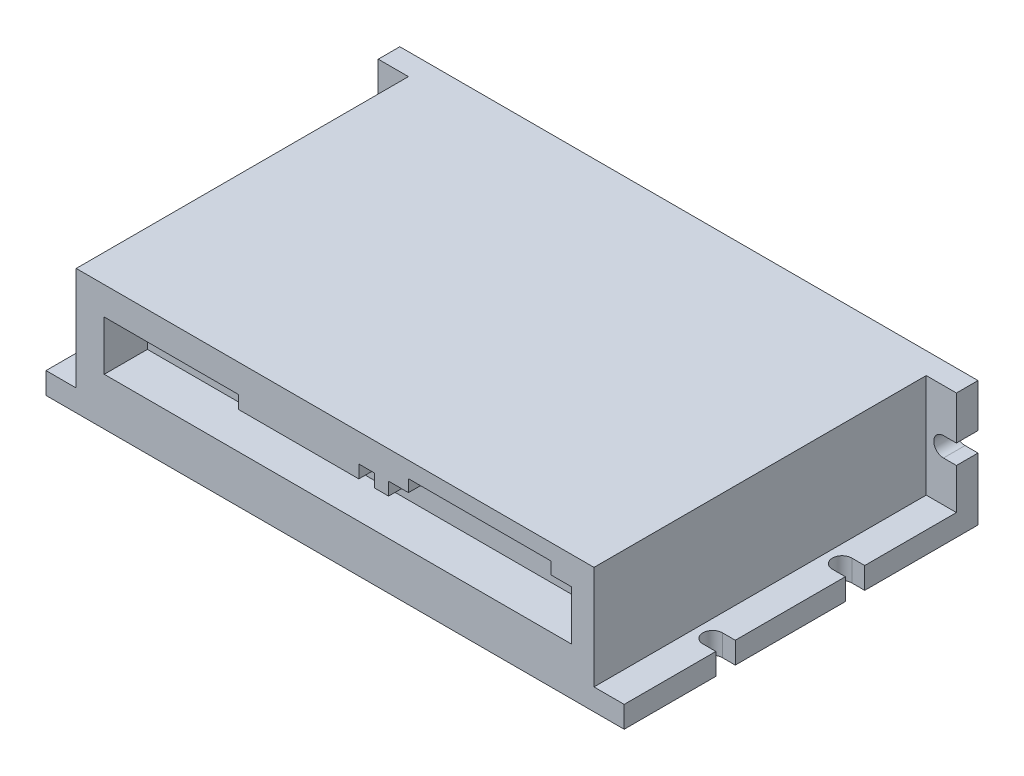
ISO-10303-21;
HEADER;
FILE_DESCRIPTION(('STEP AP214'),'2;1');
FILE_NAME('part.step','',(''),(''),'','','');
FILE_SCHEMA(('AUTOMOTIVE_DESIGN { 1 0 10303 214 1 1 1 1 }'));
ENDSEC;
DATA;
#1=APPLICATION_CONTEXT('core data for automotive mechanical design processes');
#2=APPLICATION_PROTOCOL_DEFINITION('international standard','automotive_design',2000,#1);
#3=PRODUCT_CONTEXT('',#1,'mechanical');
#4=PRODUCT('Part','Part','',(#3));
#5=PRODUCT_RELATED_PRODUCT_CATEGORY('part','',(#4));
#6=PRODUCT_DEFINITION_FORMATION('','',#4);
#7=PRODUCT_DEFINITION_CONTEXT('part definition',#1,'design');
#8=PRODUCT_DEFINITION('design','',#6,#7);
#9=PRODUCT_DEFINITION_SHAPE('','',#8);
#10=(LENGTH_UNIT() NAMED_UNIT(*) SI_UNIT(.MILLI.,.METRE.));
#11=(NAMED_UNIT(*) PLANE_ANGLE_UNIT() SI_UNIT($,.RADIAN.));
#12=(NAMED_UNIT(*) SI_UNIT($,.STERADIAN.) SOLID_ANGLE_UNIT());
#13=UNCERTAINTY_MEASURE_WITH_UNIT(LENGTH_MEASURE(1.E-05),#10,'distance_accuracy_value','');
#14=(GEOMETRIC_REPRESENTATION_CONTEXT(3) GLOBAL_UNCERTAINTY_ASSIGNED_CONTEXT((#13)) GLOBAL_UNIT_ASSIGNED_CONTEXT((#10,
#11,#12)) REPRESENTATION_CONTEXT('',''));
#15=CARTESIAN_POINT('',(0.,0.,0.));
#16=DIRECTION('',(0.,0.,1.));
#17=DIRECTION('',(1.,0.,0.));
#18=AXIS2_PLACEMENT_3D('',#15,#16,#17);
#19=CARTESIAN_POINT('',(134.,29.,0.));
#20=DIRECTION('',(-1.,0.,0.));
#21=DIRECTION('',(0.,0.,1.));
#22=AXIS2_PLACEMENT_3D('',#19,#20,#21);
#23=PLANE('',#22);
#24=DIRECTION('',(0.,0.,1.));
#25=VECTOR('',#24,1.);
#26=CARTESIAN_POINT('',(134.,5.,-77.));
#27=LINE('',#26,#25);
#28=CARTESIAN_POINT('',(134.,5.,-51.25));
#29=VERTEX_POINT('',#28);
#30=CARTESIAN_POINT('',(134.,5.,-25.75));
#31=VERTEX_POINT('',#30);
#32=EDGE_CURVE('E665',#29,#31,#27,.T.);
#33=ORIENTED_EDGE('',*,*,#32,.T.);
#34=DIRECTION('',(0.,1.,0.));
#35=VECTOR('',#34,1.);
#36=CARTESIAN_POINT('',(134.,0.,-25.75));
#37=LINE('',#36,#35);
#38=CARTESIAN_POINT('',(134.,0.,-25.75));
#39=VERTEX_POINT('',#38);
#40=EDGE_CURVE('E505',#39,#31,#37,.T.);
#41=ORIENTED_EDGE('',*,*,#40,.F.);
#42=DIRECTION('',(0.,0.,-1.));
#43=VECTOR('',#42,1.);
#44=CARTESIAN_POINT('',(134.,0.,0.));
#45=LINE('',#44,#43);
#46=CARTESIAN_POINT('',(134.,0.,-51.25));
#47=VERTEX_POINT('',#46);
#48=EDGE_CURVE('E719',#39,#47,#45,.T.);
#49=ORIENTED_EDGE('',*,*,#48,.T.);
#50=DIRECTION('',(0.,1.,0.));
#51=VECTOR('',#50,1.);
#52=CARTESIAN_POINT('',(134.,0.,-51.25));
#53=LINE('',#52,#51);
#54=EDGE_CURVE('E532',#47,#29,#53,.T.);
#55=ORIENTED_EDGE('',*,*,#54,.T.);
#56=EDGE_LOOP('',(#33,#41,#49,#55));
#57=FACE_BOUND('',#56,.T.);
#58=ADVANCED_FACE('F35',(#57),#23,.F.);
#59=CARTESIAN_POINT('',(134.,5.,-77.));
#60=VERTEX_POINT('',#59);
#61=CARTESIAN_POINT('',(134.,5.,-55.75));
#62=VERTEX_POINT('',#61);
#63=EDGE_CURVE('E661',#60,#62,#27,.T.);
#64=ORIENTED_EDGE('',*,*,#63,.T.);
#65=DIRECTION('',(0.,1.,0.));
#66=VECTOR('',#65,1.);
#67=CARTESIAN_POINT('',(134.,0.,-55.75));
#68=LINE('',#67,#66);
#69=CARTESIAN_POINT('',(134.,0.,-55.75));
#70=VERTEX_POINT('',#69);
#71=EDGE_CURVE('E530',#70,#62,#68,.T.);
#72=ORIENTED_EDGE('',*,*,#71,.F.);
#73=CARTESIAN_POINT('',(134.,0.,-82.));
#74=VERTEX_POINT('',#73);
#75=EDGE_CURVE('E715',#70,#74,#45,.T.);
#76=ORIENTED_EDGE('',*,*,#75,.T.);
#77=DIRECTION('',(0.,-1.,0.));
#78=VECTOR('',#77,1.);
#79=CARTESIAN_POINT('',(134.,29.,-82.));
#80=LINE('',#79,#78);
#81=CARTESIAN_POINT('',(134.,14.45,-82.));
#82=VERTEX_POINT('',#81);
#83=EDGE_CURVE('E725',#82,#74,#80,.T.);
#84=ORIENTED_EDGE('',*,*,#83,.F.);
#85=DIRECTION('',(0.,0.,1.));
#86=VECTOR('',#85,1.);
#87=CARTESIAN_POINT('',(134.,14.45,-129.));
#88=LINE('',#87,#86);
#89=CARTESIAN_POINT('',(134.,14.45,-77.));
#90=VERTEX_POINT('',#89);
#91=EDGE_CURVE('E624',#82,#90,#88,.T.);
#92=ORIENTED_EDGE('',*,*,#91,.T.);
#93=DIRECTION('',(0.,1.,0.));
#94=VECTOR('',#93,1.);
#95=CARTESIAN_POINT('',(134.,29.,-77.));
#96=LINE('',#95,#94);
#97=EDGE_CURVE('E642',#60,#90,#96,.T.);
#98=ORIENTED_EDGE('',*,*,#97,.F.);
#99=EDGE_LOOP('',(#64,#72,#76,#84,#92,#98));
#100=FACE_BOUND('',#99,.T.);
#101=ADVANCED_FACE('F766',(#100),#23,.F.);
#102=CARTESIAN_POINT('',(0.,29.,0.));
#103=DIRECTION('',(1.,0.,0.));
#104=DIRECTION('',(0.,0.,-1.));
#105=AXIS2_PLACEMENT_3D('',#102,#103,#104);
#106=PLANE('',#105);
#107=DIRECTION('',(0.,0.,1.));
#108=VECTOR('',#107,1.);
#109=CARTESIAN_POINT('',(0.,5.,-77.));
#110=LINE('',#109,#108);
#111=CARTESIAN_POINT('',(0.,5.,-51.25));
#112=VERTEX_POINT('',#111);
#113=CARTESIAN_POINT('',(0.,5.,-25.75));
#114=VERTEX_POINT('',#113);
#115=EDGE_CURVE('E695',#112,#114,#110,.T.);
#116=ORIENTED_EDGE('',*,*,#115,.F.);
#117=DIRECTION('',(0.,1.,0.));
#118=VECTOR('',#117,1.);
#119=CARTESIAN_POINT('',(0.,0.,-51.25));
#120=LINE('',#119,#118);
#121=CARTESIAN_POINT('',(0.,0.,-51.25));
#122=VERTEX_POINT('',#121);
#123=EDGE_CURVE('E556',#122,#112,#120,.T.);
#124=ORIENTED_EDGE('',*,*,#123,.F.);
#125=DIRECTION('',(0.,0.,1.));
#126=VECTOR('',#125,1.);
#127=CARTESIAN_POINT('',(0.,0.,0.));
#128=LINE('',#127,#126);
#129=CARTESIAN_POINT('',(0.,0.,-25.75));
#130=VERTEX_POINT('',#129);
#131=EDGE_CURVE('E712',#122,#130,#128,.T.);
#132=ORIENTED_EDGE('',*,*,#131,.T.);
#133=DIRECTION('',(0.,1.,0.));
#134=VECTOR('',#133,1.);
#135=CARTESIAN_POINT('',(0.,0.,-25.75));
#136=LINE('',#135,#134);
#137=EDGE_CURVE('E585',#130,#114,#136,.T.);
#138=ORIENTED_EDGE('',*,*,#137,.T.);
#139=EDGE_LOOP('',(#116,#124,#132,#138));
#140=FACE_BOUND('',#139,.T.);
#141=ADVANCED_FACE('F842',(#140),#106,.F.);
#142=CARTESIAN_POINT('',(0.,5.,-21.25));
#143=VERTEX_POINT('',#142);
#144=CARTESIAN_POINT('',(0.,5.,0.));
#145=VERTEX_POINT('',#144);
#146=EDGE_CURVE('E681',#143,#145,#110,.T.);
#147=ORIENTED_EDGE('',*,*,#146,.F.);
#148=DIRECTION('',(0.,1.,0.));
#149=VECTOR('',#148,1.);
#150=CARTESIAN_POINT('',(0.,0.,-21.25));
#151=LINE('',#150,#149);
#152=CARTESIAN_POINT('',(0.,0.,-21.25));
#153=VERTEX_POINT('',#152);
#154=EDGE_CURVE('E583',#153,#143,#151,.T.);
#155=ORIENTED_EDGE('',*,*,#154,.F.);
#156=CARTESIAN_POINT('',(0.,0.,0.));
#157=VERTEX_POINT('',#156);
#158=EDGE_CURVE('E689',#153,#157,#128,.T.);
#159=ORIENTED_EDGE('',*,*,#158,.T.);
#160=DIRECTION('',(0.,-1.,0.));
#161=VECTOR('',#160,1.);
#162=CARTESIAN_POINT('',(0.,29.,0.));
#163=LINE('',#162,#161);
#164=EDGE_CURVE('E11',#145,#157,#163,.T.);
#165=ORIENTED_EDGE('',*,*,#164,.F.);
#166=EDGE_LOOP('',(#147,#155,#159,#165));
#167=FACE_BOUND('',#166,.T.);
#168=ADVANCED_FACE('F855',(#167),#106,.F.);
#169=DIRECTION('',(0.,-1.,0.));
#170=VECTOR('',#169,1.);
#171=CARTESIAN_POINT('',(0.,29.,-82.));
#172=LINE('',#171,#170);
#173=CARTESIAN_POINT('',(0.,29.,-82.));
#174=VERTEX_POINT('',#173);
#175=CARTESIAN_POINT('',(0.,18.95,-82.));
#176=VERTEX_POINT('',#175);
#177=EDGE_CURVE('E722',#174,#176,#172,.T.);
#178=ORIENTED_EDGE('',*,*,#177,.T.);
#179=DIRECTION('',(0.,0.,1.));
#180=VECTOR('',#179,1.);
#181=CARTESIAN_POINT('',(0.,18.95,-129.));
#182=LINE('',#181,#180);
#183=CARTESIAN_POINT('',(0.,18.95,-77.));
#184=VERTEX_POINT('',#183);
#185=EDGE_CURVE('E598',#176,#184,#182,.T.);
#186=ORIENTED_EDGE('',*,*,#185,.T.);
#187=DIRECTION('',(0.,-1.,0.));
#188=VECTOR('',#187,1.);
#189=CARTESIAN_POINT('',(0.,29.,-77.));
#190=LINE('',#189,#188);
#191=CARTESIAN_POINT('',(0.,29.,-77.));
#192=VERTEX_POINT('',#191);
#193=EDGE_CURVE('E670',#192,#184,#190,.T.);
#194=ORIENTED_EDGE('',*,*,#193,.F.);
#195=DIRECTION('',(0.,0.,1.));
#196=VECTOR('',#195,1.);
#197=CARTESIAN_POINT('',(0.,29.,0.));
#198=LINE('',#197,#196);
#199=EDGE_CURVE('E696',#174,#192,#198,.T.);
#200=ORIENTED_EDGE('',*,*,#199,.F.);
#201=EDGE_LOOP('',(#178,#186,#194,#200));
#202=FACE_BOUND('',#201,.T.);
#203=ADVANCED_FACE('F792',(#202),#106,.F.);
#204=CARTESIAN_POINT('',(134.,0.,0.));
#205=VERTEX_POINT('',#204);
#206=CARTESIAN_POINT('',(134.,0.,-21.25));
#207=VERTEX_POINT('',#206);
#208=EDGE_CURVE('E716',#205,#207,#45,.T.);
#209=ORIENTED_EDGE('',*,*,#208,.T.);
#210=DIRECTION('',(0.,1.,0.));
#211=VECTOR('',#210,1.);
#212=CARTESIAN_POINT('',(134.,0.,-21.25));
#213=LINE('',#212,#211);
#214=CARTESIAN_POINT('',(134.,5.,-21.25));
#215=VERTEX_POINT('',#214);
#216=EDGE_CURVE('E507',#207,#215,#213,.T.);
#217=ORIENTED_EDGE('',*,*,#216,.T.);
#218=CARTESIAN_POINT('',(134.,5.,0.));
#219=VERTEX_POINT('',#218);
#220=EDGE_CURVE('E666',#215,#219,#27,.T.);
#221=ORIENTED_EDGE('',*,*,#220,.T.);
#222=DIRECTION('',(0.,-1.,0.));
#223=VECTOR('',#222,1.);
#224=CARTESIAN_POINT('',(134.,29.,0.));
#225=LINE('',#224,#223);
#226=EDGE_CURVE('E43',#219,#205,#225,.T.);
#227=ORIENTED_EDGE('',*,*,#226,.T.);
#228=EDGE_LOOP('',(#209,#217,#221,#227));
#229=FACE_BOUND('',#228,.T.);
#230=ADVANCED_FACE('F730',(#229),#23,.F.);
#231=CARTESIAN_POINT('',(0.,0.,-82.));
#232=VERTEX_POINT('',#231);
#233=CARTESIAN_POINT('',(0.,0.,-55.75));
#234=VERTEX_POINT('',#233);
#235=EDGE_CURVE('E708',#232,#234,#128,.T.);
#236=ORIENTED_EDGE('',*,*,#235,.T.);
#237=DIRECTION('',(0.,1.,0.));
#238=VECTOR('',#237,1.);
#239=CARTESIAN_POINT('',(0.,0.,-55.75));
#240=LINE('',#239,#238);
#241=CARTESIAN_POINT('',(0.,5.,-55.75));
#242=VERTEX_POINT('',#241);
#243=EDGE_CURVE('E558',#234,#242,#240,.T.);
#244=ORIENTED_EDGE('',*,*,#243,.T.);
#245=CARTESIAN_POINT('',(0.,5.,-77.));
#246=VERTEX_POINT('',#245);
#247=EDGE_CURVE('E692',#246,#242,#110,.T.);
#248=ORIENTED_EDGE('',*,*,#247,.F.);
#249=CARTESIAN_POINT('',(0.,14.45,-77.));
#250=VERTEX_POINT('',#249);
#251=EDGE_CURVE('E674',#250,#246,#190,.T.);
#252=ORIENTED_EDGE('',*,*,#251,.F.);
#253=DIRECTION('',(0.,0.,1.));
#254=VECTOR('',#253,1.);
#255=CARTESIAN_POINT('',(0.,14.45,-129.));
#256=LINE('',#255,#254);
#257=CARTESIAN_POINT('',(0.,14.45,-82.));
#258=VERTEX_POINT('',#257);
#259=EDGE_CURVE('E597',#258,#250,#256,.T.);
#260=ORIENTED_EDGE('',*,*,#259,.F.);
#261=EDGE_CURVE('E707',#258,#232,#172,.T.);
#262=ORIENTED_EDGE('',*,*,#261,.T.);
#263=EDGE_LOOP('',(#236,#244,#248,#252,#260,#262));
#264=FACE_BOUND('',#263,.T.);
#265=ADVANCED_FACE('F37',(#264),#106,.F.);
#266=CARTESIAN_POINT('',(0.,29.,0.));
#267=DIRECTION('',(0.,0.,-1.));
#268=DIRECTION('',(-1.,0.,0.));
#269=AXIS2_PLACEMENT_3D('',#266,#267,#268);
#270=PLANE('',#269);
#271=DIRECTION('',(-1.,0.,0.));
#272=VECTOR('',#271,1.);
#273=CARTESIAN_POINT('',(117.,22.5,0.));
#274=LINE('',#273,#272);
#275=CARTESIAN_POINT('',(121.8,22.5,0.));
#276=VERTEX_POINT('',#275);
#277=CARTESIAN_POINT('',(117.,22.5,0.));
#278=VERTEX_POINT('',#277);
#279=EDGE_CURVE('E417',#276,#278,#274,.T.);
#280=ORIENTED_EDGE('',*,*,#279,.F.);
#281=DIRECTION('',(0.,1.,0.));
#282=VECTOR('',#281,1.);
#283=CARTESIAN_POINT('',(121.8,22.5,0.));
#284=LINE('',#283,#282);
#285=CARTESIAN_POINT('',(121.8,11.,0.));
#286=VERTEX_POINT('',#285);
#287=EDGE_CURVE('E50',#286,#276,#284,.T.);
#288=ORIENTED_EDGE('',*,*,#287,.F.);
#289=DIRECTION('',(1.,0.,0.));
#290=VECTOR('',#289,1.);
#291=CARTESIAN_POINT('',(13.5,11.,0.));
#292=LINE('',#291,#290);
#293=CARTESIAN_POINT('',(13.5,11.,0.));
#294=VERTEX_POINT('',#293);
#295=EDGE_CURVE('E373',#294,#286,#292,.T.);
#296=ORIENTED_EDGE('',*,*,#295,.F.);
#297=DIRECTION('',(0.,-1.,0.));
#298=VECTOR('',#297,1.);
#299=CARTESIAN_POINT('',(13.5,11.,0.));
#300=LINE('',#299,#298);
#301=CARTESIAN_POINT('',(13.5,22.5,0.));
#302=VERTEX_POINT('',#301);
#303=EDGE_CURVE('E376',#302,#294,#300,.T.);
#304=ORIENTED_EDGE('',*,*,#303,.F.);
#305=DIRECTION('',(-1.,0.,0.));
#306=VECTOR('',#305,1.);
#307=CARTESIAN_POINT('',(13.5,22.5,0.));
#308=LINE('',#307,#306);
#309=CARTESIAN_POINT('',(44.6,22.5,0.));
#310=VERTEX_POINT('',#309);
#311=EDGE_CURVE('E452',#310,#302,#308,.T.);
#312=ORIENTED_EDGE('',*,*,#311,.F.);
#313=DIRECTION('',(0.,1.,0.));
#314=VECTOR('',#313,1.);
#315=CARTESIAN_POINT('',(44.6,22.5,0.));
#316=LINE('',#315,#314);
#317=CARTESIAN_POINT('',(44.6,19.5,0.));
#318=VERTEX_POINT('',#317);
#319=EDGE_CURVE('E449',#318,#310,#316,.T.);
#320=ORIENTED_EDGE('',*,*,#319,.F.);
#321=DIRECTION('',(-1.,0.,0.));
#322=VECTOR('',#321,1.);
#323=CARTESIAN_POINT('',(44.6,19.5,0.));
#324=LINE('',#323,#322);
#325=CARTESIAN_POINT('',(72.5,19.5,0.));
#326=VERTEX_POINT('',#325);
#327=EDGE_CURVE('E446',#326,#318,#324,.T.);
#328=ORIENTED_EDGE('',*,*,#327,.F.);
#329=DIRECTION('',(0.,-1.,0.));
#330=VECTOR('',#329,1.);
#331=CARTESIAN_POINT('',(72.5,19.5,0.));
#332=LINE('',#331,#330);
#333=CARTESIAN_POINT('',(72.5,22.5,0.));
#334=VERTEX_POINT('',#333);
#335=EDGE_CURVE('E443',#334,#326,#332,.T.);
#336=ORIENTED_EDGE('',*,*,#335,.F.);
#337=DIRECTION('',(-1.,0.,0.));
#338=VECTOR('',#337,1.);
#339=CARTESIAN_POINT('',(72.5,22.5,0.));
#340=LINE('',#339,#338);
#341=CARTESIAN_POINT('',(76.1,22.5,0.));
#342=VERTEX_POINT('',#341);
#343=EDGE_CURVE('E440',#342,#334,#340,.T.);
#344=ORIENTED_EDGE('',*,*,#343,.F.);
#345=DIRECTION('',(0.,1.,0.));
#346=VECTOR('',#345,1.);
#347=CARTESIAN_POINT('',(76.1,22.5,0.));
#348=LINE('',#347,#346);
#349=CARTESIAN_POINT('',(76.1,19.5,0.));
#350=VERTEX_POINT('',#349);
#351=EDGE_CURVE('E437',#350,#342,#348,.T.);
#352=ORIENTED_EDGE('',*,*,#351,.F.);
#353=DIRECTION('',(-1.,0.,0.));
#354=VECTOR('',#353,1.);
#355=CARTESIAN_POINT('',(76.1,19.5,0.));
#356=LINE('',#355,#354);
#357=CARTESIAN_POINT('',(79.4,19.5,0.));
#358=VERTEX_POINT('',#357);
#359=EDGE_CURVE('E434',#358,#350,#356,.T.);
#360=ORIENTED_EDGE('',*,*,#359,.F.);
#361=DIRECTION('',(0.,-1.,0.));
#362=VECTOR('',#361,1.);
#363=CARTESIAN_POINT('',(79.4,19.5,0.));
#364=LINE('',#363,#362);
#365=CARTESIAN_POINT('',(79.4,22.5,0.));
#366=VERTEX_POINT('',#365);
#367=EDGE_CURVE('E431',#366,#358,#364,.T.);
#368=ORIENTED_EDGE('',*,*,#367,.F.);
#369=DIRECTION('',(-1.,0.,0.));
#370=VECTOR('',#369,1.);
#371=CARTESIAN_POINT('',(79.4,22.5,0.));
#372=LINE('',#371,#370);
#373=CARTESIAN_POINT('',(84.,22.5,0.));
#374=VERTEX_POINT('',#373);
#375=EDGE_CURVE('E428',#374,#366,#372,.T.);
#376=ORIENTED_EDGE('',*,*,#375,.F.);
#377=DIRECTION('',(0.,-1.,0.));
#378=VECTOR('',#377,1.);
#379=CARTESIAN_POINT('',(84.,22.5,0.));
#380=LINE('',#379,#378);
#381=CARTESIAN_POINT('',(84.,25.3,0.));
#382=VERTEX_POINT('',#381);
#383=EDGE_CURVE('E425',#382,#374,#380,.T.);
#384=ORIENTED_EDGE('',*,*,#383,.F.);
#385=DIRECTION('',(-1.,0.,0.));
#386=VECTOR('',#385,1.);
#387=CARTESIAN_POINT('',(84.,25.3,0.));
#388=LINE('',#387,#386);
#389=CARTESIAN_POINT('',(117.,25.3,0.));
#390=VERTEX_POINT('',#389);
#391=EDGE_CURVE('E422',#390,#382,#388,.T.);
#392=ORIENTED_EDGE('',*,*,#391,.F.);
#393=DIRECTION('',(0.,1.,0.));
#394=VECTOR('',#393,1.);
#395=CARTESIAN_POINT('',(117.,25.3,0.));
#396=LINE('',#395,#394);
#397=EDGE_CURVE('E419',#278,#390,#396,.T.);
#398=ORIENTED_EDGE('',*,*,#397,.F.);
#399=EDGE_LOOP('',(#280,#288,#296,#304,#312,#320,#328,#336,#344,#352,#360,#368,#376,#384,#392,#398));
#400=FACE_BOUND('',#399,.T.);
#401=ORIENTED_EDGE('',*,*,#226,.F.);
#402=DIRECTION('',(1.,0.,0.));
#403=VECTOR('',#402,1.);
#404=CARTESIAN_POINT('',(134.,5.,0.));
#405=LINE('',#404,#403);
#406=CARTESIAN_POINT('',(127.,5.,0.));
#407=VERTEX_POINT('',#406);
#408=EDGE_CURVE('E658',#407,#219,#405,.T.);
#409=ORIENTED_EDGE('',*,*,#408,.F.);
#410=DIRECTION('',(0.,-1.,0.));
#411=VECTOR('',#410,1.);
#412=CARTESIAN_POINT('',(127.,29.,0.));
#413=LINE('',#412,#411);
#414=CARTESIAN_POINT('',(127.,29.,0.));
#415=VERTEX_POINT('',#414);
#416=EDGE_CURVE('E641',#415,#407,#413,.T.);
#417=ORIENTED_EDGE('',*,*,#416,.F.);
#418=DIRECTION('',(1.,0.,0.));
#419=VECTOR('',#418,1.);
#420=CARTESIAN_POINT('',(0.,29.,0.));
#421=LINE('',#420,#419);
#422=CARTESIAN_POINT('',(7.,29.,0.));
#423=VERTEX_POINT('',#422);
#424=EDGE_CURVE('E699',#423,#415,#421,.T.);
#425=ORIENTED_EDGE('',*,*,#424,.F.);
#426=DIRECTION('',(0.,1.,0.));
#427=VECTOR('',#426,1.);
#428=CARTESIAN_POINT('',(7.,29.,0.));
#429=LINE('',#428,#427);
#430=CARTESIAN_POINT('',(7.,5.,0.));
#431=VERTEX_POINT('',#430);
#432=EDGE_CURVE('E684',#431,#423,#429,.T.);
#433=ORIENTED_EDGE('',*,*,#432,.F.);
#434=DIRECTION('',(1.,0.,0.));
#435=VECTOR('',#434,1.);
#436=CARTESIAN_POINT('',(0.,5.,0.));
#437=LINE('',#436,#435);
#438=EDGE_CURVE('E664',#145,#431,#437,.T.);
#439=ORIENTED_EDGE('',*,*,#438,.F.);
#440=ORIENTED_EDGE('',*,*,#164,.T.);
#441=DIRECTION('',(1.,0.,0.));
#442=VECTOR('',#441,1.);
#443=CARTESIAN_POINT('',(0.,0.,0.));
#444=LINE('',#443,#442);
#445=EDGE_CURVE('E711',#157,#205,#444,.T.);
#446=ORIENTED_EDGE('',*,*,#445,.T.);
#447=EDGE_LOOP('',(#401,#409,#417,#425,#433,#439,#440,#446));
#448=FACE_BOUND('',#447,.T.);
#449=ADVANCED_FACE('F736',(#400,#448),#270,.F.);
#450=CARTESIAN_POINT('',(134.,18.95,-77.));
#451=VERTEX_POINT('',#450);
#452=CARTESIAN_POINT('',(134.,29.,-77.));
#453=VERTEX_POINT('',#452);
#454=EDGE_CURVE('E646',#451,#453,#96,.T.);
#455=ORIENTED_EDGE('',*,*,#454,.F.);
#456=DIRECTION('',(0.,0.,1.));
#457=VECTOR('',#456,1.);
#458=CARTESIAN_POINT('',(134.,18.95,-129.));
#459=LINE('',#458,#457);
#460=CARTESIAN_POINT('',(134.,18.95,-82.));
#461=VERTEX_POINT('',#460);
#462=EDGE_CURVE('E623',#461,#451,#459,.T.);
#463=ORIENTED_EDGE('',*,*,#462,.F.);
#464=CARTESIAN_POINT('',(134.,29.,-82.));
#465=VERTEX_POINT('',#464);
#466=EDGE_CURVE('E726',#465,#461,#80,.T.);
#467=ORIENTED_EDGE('',*,*,#466,.F.);
#468=DIRECTION('',(0.,0.,-1.));
#469=VECTOR('',#468,1.);
#470=CARTESIAN_POINT('',(134.,29.,0.));
#471=LINE('',#470,#469);
#472=EDGE_CURVE('E703',#453,#465,#471,.T.);
#473=ORIENTED_EDGE('',*,*,#472,.F.);
#474=EDGE_LOOP('',(#455,#463,#467,#473));
#475=FACE_BOUND('',#474,.T.);
#476=ADVANCED_FACE('F803',(#475),#23,.F.);
#477=CARTESIAN_POINT('',(0.,29.,-82.));
#478=DIRECTION('',(0.,0.,1.));
#479=DIRECTION('',(1.,0.,0.));
#480=AXIS2_PLACEMENT_3D('',#477,#478,#479);
#481=PLANE('',#480);
#482=CARTESIAN_POINT('',(3.,16.7,-82.));
#483=DIRECTION('',(0.,0.,1.));
#484=DIRECTION('',(1.,0.,0.));
#485=AXIS2_PLACEMENT_3D('',#482,#483,#484);
#486=CIRCLE('',#485,2.25);
#487=CARTESIAN_POINT('',(3.,14.45,-82.));
#488=VERTEX_POINT('',#487);
#489=CARTESIAN_POINT('',(3.,18.95,-82.));
#490=VERTEX_POINT('',#489);
#491=EDGE_CURVE('E609',#488,#490,#486,.T.);
#492=ORIENTED_EDGE('',*,*,#491,.T.);
#493=DIRECTION('',(-1.,0.,0.));
#494=VECTOR('',#493,1.);
#495=CARTESIAN_POINT('',(0.,18.95,-82.));
#496=LINE('',#495,#494);
#497=EDGE_CURVE('E612',#490,#176,#496,.T.);
#498=ORIENTED_EDGE('',*,*,#497,.T.);
#499=ORIENTED_EDGE('',*,*,#177,.F.);
#500=DIRECTION('',(-1.,0.,0.));
#501=VECTOR('',#500,1.);
#502=CARTESIAN_POINT('',(0.,29.,-82.));
#503=LINE('',#502,#501);
#504=EDGE_CURVE('E705',#465,#174,#503,.T.);
#505=ORIENTED_EDGE('',*,*,#504,.F.);
#506=ORIENTED_EDGE('',*,*,#466,.T.);
#507=DIRECTION('',(-1.,0.,0.));
#508=VECTOR('',#507,1.);
#509=CARTESIAN_POINT('',(0.,18.95,-82.));
#510=LINE('',#509,#508);
#511=CARTESIAN_POINT('',(131.,18.95,-82.));
#512=VERTEX_POINT('',#511);
#513=EDGE_CURVE('E627',#461,#512,#510,.T.);
#514=ORIENTED_EDGE('',*,*,#513,.T.);
#515=CARTESIAN_POINT('',(131.,16.7,-82.));
#516=DIRECTION('',(0.,0.,1.));
#517=DIRECTION('',(1.,0.,0.));
#518=AXIS2_PLACEMENT_3D('',#515,#516,#517);
#519=CIRCLE('',#518,2.25);
#520=CARTESIAN_POINT('',(131.,14.45,-82.));
#521=VERTEX_POINT('',#520);
#522=EDGE_CURVE('E635',#512,#521,#519,.T.);
#523=ORIENTED_EDGE('',*,*,#522,.T.);
#524=DIRECTION('',(1.,0.,0.));
#525=VECTOR('',#524,1.);
#526=CARTESIAN_POINT('',(0.,14.4499999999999,-82.));
#527=LINE('',#526,#525);
#528=EDGE_CURVE('E638',#521,#82,#527,.T.);
#529=ORIENTED_EDGE('',*,*,#528,.T.);
#530=ORIENTED_EDGE('',*,*,#83,.T.);
#531=DIRECTION('',(-1.,0.,0.));
#532=VECTOR('',#531,1.);
#533=CARTESIAN_POINT('',(0.,0.,-82.));
#534=LINE('',#533,#532);
#535=EDGE_CURVE('E700',#74,#232,#534,.T.);
#536=ORIENTED_EDGE('',*,*,#535,.T.);
#537=ORIENTED_EDGE('',*,*,#261,.F.);
#538=DIRECTION('',(1.,0.,0.));
#539=VECTOR('',#538,1.);
#540=CARTESIAN_POINT('',(0.,14.45,-82.));
#541=LINE('',#540,#539);
#542=EDGE_CURVE('E601',#258,#488,#541,.T.);
#543=ORIENTED_EDGE('',*,*,#542,.T.);
#544=EDGE_LOOP('',(#492,#498,#499,#505,#506,#514,#523,#529,#530,#536,#537,#543));
#545=FACE_BOUND('',#544,.T.);
#546=ADVANCED_FACE('F769',(#545),#481,.F.);
#547=CARTESIAN_POINT('',(0.,29.,0.));
#548=DIRECTION('',(0.,-1.,0.));
#549=DIRECTION('',(0.,0.,-1.));
#550=AXIS2_PLACEMENT_3D('',#547,#548,#549);
#551=PLANE('',#550);
#552=ORIENTED_EDGE('',*,*,#424,.T.);
#553=DIRECTION('',(0.,0.,1.));
#554=VECTOR('',#553,1.);
#555=CARTESIAN_POINT('',(127.,29.,-77.));
#556=LINE('',#555,#554);
#557=CARTESIAN_POINT('',(127.,29.,-77.));
#558=VERTEX_POINT('',#557);
#559=EDGE_CURVE('E655',#558,#415,#556,.T.);
#560=ORIENTED_EDGE('',*,*,#559,.F.);
#561=DIRECTION('',(-1.,0.,0.));
#562=VECTOR('',#561,1.);
#563=CARTESIAN_POINT('',(134.,29.,-77.));
#564=LINE('',#563,#562);
#565=EDGE_CURVE('E645',#453,#558,#564,.T.);
#566=ORIENTED_EDGE('',*,*,#565,.F.);
#567=ORIENTED_EDGE('',*,*,#472,.T.);
#568=ORIENTED_EDGE('',*,*,#504,.T.);
#569=ORIENTED_EDGE('',*,*,#199,.T.);
#570=DIRECTION('',(-1.,0.,0.));
#571=VECTOR('',#570,1.);
#572=CARTESIAN_POINT('',(0.,29.,-77.));
#573=LINE('',#572,#571);
#574=CARTESIAN_POINT('',(7.,29.,-77.));
#575=VERTEX_POINT('',#574);
#576=EDGE_CURVE('E679',#575,#192,#573,.T.);
#577=ORIENTED_EDGE('',*,*,#576,.F.);
#578=DIRECTION('',(0.,0.,1.));
#579=VECTOR('',#578,1.);
#580=CARTESIAN_POINT('',(7.,29.,-77.));
#581=LINE('',#580,#579);
#582=EDGE_CURVE('E686',#575,#423,#581,.T.);
#583=ORIENTED_EDGE('',*,*,#582,.T.);
#584=EDGE_LOOP('',(#552,#560,#566,#567,#568,#569,#577,#583));
#585=FACE_BOUND('',#584,.T.);
#586=ADVANCED_FACE('F796',(#585),#551,.F.);
#587=CARTESIAN_POINT('',(0.,0.,0.));
#588=DIRECTION('',(0.,-1.,0.));
#589=DIRECTION('',(0.,0.,-1.));
#590=AXIS2_PLACEMENT_3D('',#587,#588,#589);
#591=PLANE('',#590);
#592=DIRECTION('',(-1.,0.,0.));
#593=VECTOR('',#592,1.);
#594=CARTESIAN_POINT('',(131.,0.,-25.75));
#595=LINE('',#594,#593);
#596=CARTESIAN_POINT('',(131.,0.,-25.75));
#597=VERTEX_POINT('',#596);
#598=EDGE_CURVE('E493',#39,#597,#595,.T.);
#599=ORIENTED_EDGE('',*,*,#598,.T.);
#600=CARTESIAN_POINT('',(131.,0.,-23.5));
#601=DIRECTION('',(0.,1.,0.));
#602=DIRECTION('',(0.,0.,1.));
#603=AXIS2_PLACEMENT_3D('',#600,#601,#602);
#604=CIRCLE('',#603,2.25);
#605=CARTESIAN_POINT('',(131.,0.,-21.25));
#606=VERTEX_POINT('',#605);
#607=EDGE_CURVE('E486',#597,#606,#604,.T.);
#608=ORIENTED_EDGE('',*,*,#607,.T.);
#609=DIRECTION('',(1.,0.,0.));
#610=VECTOR('',#609,1.);
#611=CARTESIAN_POINT('',(134.,0.,-21.25));
#612=LINE('',#611,#610);
#613=EDGE_CURVE('E489',#606,#207,#612,.T.);
#614=ORIENTED_EDGE('',*,*,#613,.T.);
#615=ORIENTED_EDGE('',*,*,#208,.F.);
#616=ORIENTED_EDGE('',*,*,#445,.F.);
#617=ORIENTED_EDGE('',*,*,#158,.F.);
#618=DIRECTION('',(1.,0.,0.));
#619=VECTOR('',#618,1.);
#620=CARTESIAN_POINT('',(0.,0.,-21.25));
#621=LINE('',#620,#619);
#622=CARTESIAN_POINT('',(3.,0.,-21.25));
#623=VERTEX_POINT('',#622);
#624=EDGE_CURVE('E570',#153,#623,#621,.T.);
#625=ORIENTED_EDGE('',*,*,#624,.T.);
#626=CARTESIAN_POINT('',(3.,0.,-23.5));
#627=DIRECTION('',(0.,1.,0.));
#628=DIRECTION('',(0.,0.,-1.));
#629=AXIS2_PLACEMENT_3D('',#626,#627,#628);
#630=CIRCLE('',#629,2.25);
#631=CARTESIAN_POINT('',(3.,0.,-25.75));
#632=VERTEX_POINT('',#631);
#633=EDGE_CURVE('E563',#623,#632,#630,.T.);
#634=ORIENTED_EDGE('',*,*,#633,.T.);
#635=DIRECTION('',(-1.,0.,0.));
#636=VECTOR('',#635,1.);
#637=CARTESIAN_POINT('',(3.,0.,-25.75));
#638=LINE('',#637,#636);
#639=EDGE_CURVE('E566',#632,#130,#638,.T.);
#640=ORIENTED_EDGE('',*,*,#639,.T.);
#641=ORIENTED_EDGE('',*,*,#131,.F.);
#642=DIRECTION('',(1.,0.,0.));
#643=VECTOR('',#642,1.);
#644=CARTESIAN_POINT('',(0.,0.,-51.25));
#645=LINE('',#644,#643);
#646=CARTESIAN_POINT('',(3.,0.,-51.25));
#647=VERTEX_POINT('',#646);
#648=EDGE_CURVE('E544',#122,#647,#645,.T.);
#649=ORIENTED_EDGE('',*,*,#648,.T.);
#650=CARTESIAN_POINT('',(3.,0.,-53.5));
#651=DIRECTION('',(0.,1.,0.));
#652=DIRECTION('',(0.,0.,-1.));
#653=AXIS2_PLACEMENT_3D('',#650,#651,#652);
#654=CIRCLE('',#653,2.25);
#655=CARTESIAN_POINT('',(3.,0.,-55.75));
#656=VERTEX_POINT('',#655);
#657=EDGE_CURVE('E537',#647,#656,#654,.T.);
#658=ORIENTED_EDGE('',*,*,#657,.T.);
#659=DIRECTION('',(-1.,0.,0.));
#660=VECTOR('',#659,1.);
#661=CARTESIAN_POINT('',(3.,0.,-55.75));
#662=LINE('',#661,#660);
#663=EDGE_CURVE('E540',#656,#234,#662,.T.);
#664=ORIENTED_EDGE('',*,*,#663,.T.);
#665=ORIENTED_EDGE('',*,*,#235,.F.);
#666=ORIENTED_EDGE('',*,*,#535,.F.);
#667=ORIENTED_EDGE('',*,*,#75,.F.);
#668=DIRECTION('',(-1.,0.,0.));
#669=VECTOR('',#668,1.);
#670=CARTESIAN_POINT('',(131.,0.,-55.75));
#671=LINE('',#670,#669);
#672=CARTESIAN_POINT('',(131.,0.,-55.75));
#673=VERTEX_POINT('',#672);
#674=EDGE_CURVE('E518',#70,#673,#671,.T.);
#675=ORIENTED_EDGE('',*,*,#674,.T.);
#676=CARTESIAN_POINT('',(131.,0.,-53.5));
#677=DIRECTION('',(0.,1.,0.));
#678=DIRECTION('',(0.,0.,1.));
#679=AXIS2_PLACEMENT_3D('',#676,#677,#678);
#680=CIRCLE('',#679,2.25);
#681=CARTESIAN_POINT('',(131.,0.,-51.25));
#682=VERTEX_POINT('',#681);
#683=EDGE_CURVE('E511',#673,#682,#680,.T.);
#684=ORIENTED_EDGE('',*,*,#683,.T.);
#685=DIRECTION('',(1.,0.,0.));
#686=VECTOR('',#685,1.);
#687=CARTESIAN_POINT('',(134.,0.,-51.25));
#688=LINE('',#687,#686);
#689=EDGE_CURVE('E514',#682,#47,#688,.T.);
#690=ORIENTED_EDGE('',*,*,#689,.T.);
#691=ORIENTED_EDGE('',*,*,#48,.F.);
#692=EDGE_LOOP('',(#599,#608,#614,#615,#616,#617,#625,#634,#640,#641,#649,#658,#664,#665,#666,
#667,#675,#684,#690,#691));
#693=FACE_BOUND('',#692,.T.);
#694=ADVANCED_FACE('F741',(#693),#591,.T.);
#695=CARTESIAN_POINT('',(7.,29.,-77.));
#696=DIRECTION('',(1.,0.,0.));
#697=DIRECTION('',(0.,1.,0.));
#698=AXIS2_PLACEMENT_3D('',#695,#696,#697);
#699=PLANE('',#698);
#700=ORIENTED_EDGE('',*,*,#432,.T.);
#701=ORIENTED_EDGE('',*,*,#582,.F.);
#702=DIRECTION('',(0.,1.,0.));
#703=VECTOR('',#702,1.);
#704=CARTESIAN_POINT('',(7.,29.,-77.));
#705=LINE('',#704,#703);
#706=CARTESIAN_POINT('',(7.,5.,-77.));
#707=VERTEX_POINT('',#706);
#708=EDGE_CURVE('E677',#707,#575,#705,.T.);
#709=ORIENTED_EDGE('',*,*,#708,.F.);
#710=DIRECTION('',(0.,0.,1.));
#711=VECTOR('',#710,1.);
#712=CARTESIAN_POINT('',(7.,5.,-77.));
#713=LINE('',#712,#711);
#714=EDGE_CURVE('E690',#707,#431,#713,.T.);
#715=ORIENTED_EDGE('',*,*,#714,.T.);
#716=EDGE_LOOP('',(#700,#701,#709,#715));
#717=FACE_BOUND('',#716,.T.);
#718=ADVANCED_FACE('F917',(#717),#699,.F.);
#719=CARTESIAN_POINT('',(0.,5.,-77.));
#720=DIRECTION('',(0.,-1.,0.));
#721=DIRECTION('',(0.,0.,-1.));
#722=AXIS2_PLACEMENT_3D('',#719,#720,#721);
#723=PLANE('',#722);
#724=CARTESIAN_POINT('',(3.,5.,-53.5));
#725=DIRECTION('',(0.,1.,0.));
#726=DIRECTION('',(0.,0.,-1.));
#727=AXIS2_PLACEMENT_3D('',#724,#725,#726);
#728=CIRCLE('',#727,2.25);
#729=CARTESIAN_POINT('',(3.,5.,-51.25));
#730=VERTEX_POINT('',#729);
#731=CARTESIAN_POINT('',(3.,5.,-55.75));
#732=VERTEX_POINT('',#731);
#733=EDGE_CURVE('E529',#730,#732,#728,.T.);
#734=ORIENTED_EDGE('',*,*,#733,.F.);
#735=DIRECTION('',(1.,0.,0.));
#736=VECTOR('',#735,1.);
#737=CARTESIAN_POINT('',(0.,5.,-51.25));
#738=LINE('',#737,#736);
#739=EDGE_CURVE('E541',#112,#730,#738,.T.);
#740=ORIENTED_EDGE('',*,*,#739,.F.);
#741=ORIENTED_EDGE('',*,*,#115,.T.);
#742=DIRECTION('',(-1.,0.,0.));
#743=VECTOR('',#742,1.);
#744=CARTESIAN_POINT('',(3.,5.,-25.75));
#745=LINE('',#744,#743);
#746=CARTESIAN_POINT('',(3.,5.,-25.75));
#747=VERTEX_POINT('',#746);
#748=EDGE_CURVE('E575',#747,#114,#745,.T.);
#749=ORIENTED_EDGE('',*,*,#748,.F.);
#750=CARTESIAN_POINT('',(3.,5.,-23.5));
#751=DIRECTION('',(0.,1.,0.));
#752=DIRECTION('',(0.,0.,-1.));
#753=AXIS2_PLACEMENT_3D('',#750,#751,#752);
#754=CIRCLE('',#753,2.25);
#755=CARTESIAN_POINT('',(3.,5.,-21.25));
#756=VERTEX_POINT('',#755);
#757=EDGE_CURVE('E555',#756,#747,#754,.T.);
#758=ORIENTED_EDGE('',*,*,#757,.F.);
#759=DIRECTION('',(1.,0.,0.));
#760=VECTOR('',#759,1.);
#761=CARTESIAN_POINT('',(0.,5.,-21.25));
#762=LINE('',#761,#760);
#763=EDGE_CURVE('E567',#143,#756,#762,.T.);
#764=ORIENTED_EDGE('',*,*,#763,.F.);
#765=ORIENTED_EDGE('',*,*,#146,.T.);
#766=ORIENTED_EDGE('',*,*,#438,.T.);
#767=ORIENTED_EDGE('',*,*,#714,.F.);
#768=DIRECTION('',(1.,0.,0.));
#769=VECTOR('',#768,1.);
#770=CARTESIAN_POINT('',(0.,5.,-77.));
#771=LINE('',#770,#769);
#772=EDGE_CURVE('E673',#246,#707,#771,.T.);
#773=ORIENTED_EDGE('',*,*,#772,.F.);
#774=ORIENTED_EDGE('',*,*,#247,.T.);
#775=DIRECTION('',(-1.,0.,0.));
#776=VECTOR('',#775,1.);
#777=CARTESIAN_POINT('',(3.,5.,-55.75));
#778=LINE('',#777,#776);
#779=EDGE_CURVE('E549',#732,#242,#778,.T.);
#780=ORIENTED_EDGE('',*,*,#779,.F.);
#781=EDGE_LOOP('',(#734,#740,#741,#749,#758,#764,#765,#766,#767,#773,#774,#780));
#782=FACE_BOUND('',#781,.T.);
#783=ADVANCED_FACE('F872',(#782),#723,.F.);
#784=CARTESIAN_POINT('',(0.,0.,-77.));
#785=DIRECTION('',(0.,0.,1.));
#786=DIRECTION('',(1.,0.,0.));
#787=AXIS2_PLACEMENT_3D('',#784,#785,#786);
#788=PLANE('',#787);
#789=DIRECTION('',(-1.,0.,0.));
#790=VECTOR('',#789,1.);
#791=CARTESIAN_POINT('',(3.,18.95,-77.));
#792=LINE('',#791,#790);
#793=CARTESIAN_POINT('',(3.,18.95,-77.));
#794=VERTEX_POINT('',#793);
#795=EDGE_CURVE('E595',#794,#184,#792,.T.);
#796=ORIENTED_EDGE('',*,*,#795,.F.);
#797=CARTESIAN_POINT('',(3.,16.7,-77.));
#798=DIRECTION('',(0.,0.,1.));
#799=DIRECTION('',(-1.,0.,0.));
#800=AXIS2_PLACEMENT_3D('',#797,#798,#799);
#801=CIRCLE('',#800,2.25);
#802=CARTESIAN_POINT('',(3.,14.45,-77.));
#803=VERTEX_POINT('',#802);
#804=EDGE_CURVE('E592',#803,#794,#801,.T.);
#805=ORIENTED_EDGE('',*,*,#804,.F.);
#806=DIRECTION('',(1.,0.,0.));
#807=VECTOR('',#806,1.);
#808=CARTESIAN_POINT('',(0.,14.45,-77.));
#809=LINE('',#808,#807);
#810=EDGE_CURVE('E582',#250,#803,#809,.T.);
#811=ORIENTED_EDGE('',*,*,#810,.F.);
#812=ORIENTED_EDGE('',*,*,#251,.T.);
#813=ORIENTED_EDGE('',*,*,#772,.T.);
#814=ORIENTED_EDGE('',*,*,#708,.T.);
#815=ORIENTED_EDGE('',*,*,#576,.T.);
#816=ORIENTED_EDGE('',*,*,#193,.T.);
#817=EDGE_LOOP('',(#796,#805,#811,#812,#813,#814,#815,#816));
#818=FACE_BOUND('',#817,.T.);
#819=ADVANCED_FACE('F910',(#818),#788,.T.);
#820=CARTESIAN_POINT('',(134.,5.,-77.));
#821=DIRECTION('',(0.,-1.,0.));
#822=DIRECTION('',(1.,0.,0.));
#823=AXIS2_PLACEMENT_3D('',#820,#821,#822);
#824=PLANE('',#823);
#825=CARTESIAN_POINT('',(131.,5.,-23.5));
#826=DIRECTION('',(0.,1.,0.));
#827=DIRECTION('',(0.,0.,1.));
#828=AXIS2_PLACEMENT_3D('',#825,#826,#827);
#829=CIRCLE('',#828,2.25);
#830=CARTESIAN_POINT('',(131.,5.,-25.75));
#831=VERTEX_POINT('',#830);
#832=CARTESIAN_POINT('',(131.,5.,-21.25));
#833=VERTEX_POINT('',#832);
#834=EDGE_CURVE('E58',#831,#833,#829,.T.);
#835=ORIENTED_EDGE('',*,*,#834,.F.);
#836=DIRECTION('',(-1.,0.,0.));
#837=VECTOR('',#836,1.);
#838=CARTESIAN_POINT('',(131.,5.,-25.75));
#839=LINE('',#838,#837);
#840=EDGE_CURVE('E490',#31,#831,#839,.T.);
#841=ORIENTED_EDGE('',*,*,#840,.F.);
#842=ORIENTED_EDGE('',*,*,#32,.F.);
#843=DIRECTION('',(1.,0.,0.));
#844=VECTOR('',#843,1.);
#845=CARTESIAN_POINT('',(134.,5.,-51.25));
#846=LINE('',#845,#844);
#847=CARTESIAN_POINT('',(131.,5.,-51.25));
#848=VERTEX_POINT('',#847);
#849=EDGE_CURVE('E523',#848,#29,#846,.T.);
#850=ORIENTED_EDGE('',*,*,#849,.F.);
#851=CARTESIAN_POINT('',(131.,5.,-53.5));
#852=DIRECTION('',(0.,1.,0.));
#853=DIRECTION('',(0.,0.,1.));
#854=AXIS2_PLACEMENT_3D('',#851,#852,#853);
#855=CIRCLE('',#854,2.25);
#856=CARTESIAN_POINT('',(131.,5.,-55.75));
#857=VERTEX_POINT('',#856);
#858=EDGE_CURVE('E504',#857,#848,#855,.T.);
#859=ORIENTED_EDGE('',*,*,#858,.F.);
#860=DIRECTION('',(-1.,0.,0.));
#861=VECTOR('',#860,1.);
#862=CARTESIAN_POINT('',(131.,5.,-55.75));
#863=LINE('',#862,#861);
#864=EDGE_CURVE('E515',#62,#857,#863,.T.);
#865=ORIENTED_EDGE('',*,*,#864,.F.);
#866=ORIENTED_EDGE('',*,*,#63,.F.);
#867=DIRECTION('',(1.,0.,0.));
#868=VECTOR('',#867,1.);
#869=CARTESIAN_POINT('',(134.,5.,-77.));
#870=LINE('',#869,#868);
#871=CARTESIAN_POINT('',(127.,5.,-77.));
#872=VERTEX_POINT('',#871);
#873=EDGE_CURVE('E652',#872,#60,#870,.T.);
#874=ORIENTED_EDGE('',*,*,#873,.F.);
#875=DIRECTION('',(0.,0.,1.));
#876=VECTOR('',#875,1.);
#877=CARTESIAN_POINT('',(127.,5.,-77.));
#878=LINE('',#877,#876);
#879=EDGE_CURVE('E667',#872,#407,#878,.T.);
#880=ORIENTED_EDGE('',*,*,#879,.T.);
#881=ORIENTED_EDGE('',*,*,#408,.T.);
#882=ORIENTED_EDGE('',*,*,#220,.F.);
#883=DIRECTION('',(1.,0.,0.));
#884=VECTOR('',#883,1.);
#885=CARTESIAN_POINT('',(134.,5.,-21.25));
#886=LINE('',#885,#884);
#887=EDGE_CURVE('E498',#833,#215,#886,.T.);
#888=ORIENTED_EDGE('',*,*,#887,.F.);
#889=EDGE_LOOP('',(#835,#841,#842,#850,#859,#865,#866,#874,#880,#881,#882,#888));
#890=FACE_BOUND('',#889,.T.);
#891=ADVANCED_FACE('F748',(#890),#824,.F.);
#892=CARTESIAN_POINT('',(127.,29.,-77.));
#893=DIRECTION('',(-1.,0.,0.));
#894=DIRECTION('',(0.,0.,1.));
#895=AXIS2_PLACEMENT_3D('',#892,#893,#894);
#896=PLANE('',#895);
#897=ORIENTED_EDGE('',*,*,#416,.T.);
#898=ORIENTED_EDGE('',*,*,#879,.F.);
#899=DIRECTION('',(0.,-1.,0.));
#900=VECTOR('',#899,1.);
#901=CARTESIAN_POINT('',(127.,29.,-77.));
#902=LINE('',#901,#900);
#903=EDGE_CURVE('E649',#558,#872,#902,.T.);
#904=ORIENTED_EDGE('',*,*,#903,.F.);
#905=ORIENTED_EDGE('',*,*,#559,.T.);
#906=EDGE_LOOP('',(#897,#898,#904,#905));
#907=FACE_BOUND('',#906,.T.);
#908=ADVANCED_FACE('F907',(#907),#896,.F.);
#909=CARTESIAN_POINT('',(0.,0.,-77.));
#910=DIRECTION('',(0.,0.,-1.));
#911=DIRECTION('',(-1.,0.,0.));
#912=AXIS2_PLACEMENT_3D('',#909,#910,#911);
#913=PLANE('',#912);
#914=ORIENTED_EDGE('',*,*,#97,.T.);
#915=DIRECTION('',(1.,0.,0.));
#916=VECTOR('',#915,1.);
#917=CARTESIAN_POINT('',(134.,14.45,-77.));
#918=LINE('',#917,#916);
#919=CARTESIAN_POINT('',(131.,14.45,-77.));
#920=VERTEX_POINT('',#919);
#921=EDGE_CURVE('E621',#920,#90,#918,.T.);
#922=ORIENTED_EDGE('',*,*,#921,.F.);
#923=CARTESIAN_POINT('',(131.,16.7,-77.));
#924=DIRECTION('',(0.,0.,1.));
#925=DIRECTION('',(1.,0.,0.));
#926=AXIS2_PLACEMENT_3D('',#923,#924,#925);
#927=CIRCLE('',#926,2.25);
#928=CARTESIAN_POINT('',(131.,18.95,-77.));
#929=VERTEX_POINT('',#928);
#930=EDGE_CURVE('E618',#929,#920,#927,.T.);
#931=ORIENTED_EDGE('',*,*,#930,.F.);
#932=DIRECTION('',(-1.,0.,0.));
#933=VECTOR('',#932,1.);
#934=CARTESIAN_POINT('',(131.,18.95,-77.));
#935=LINE('',#934,#933);
#936=EDGE_CURVE('E615',#451,#929,#935,.T.);
#937=ORIENTED_EDGE('',*,*,#936,.F.);
#938=ORIENTED_EDGE('',*,*,#454,.T.);
#939=ORIENTED_EDGE('',*,*,#565,.T.);
#940=ORIENTED_EDGE('',*,*,#903,.T.);
#941=ORIENTED_EDGE('',*,*,#873,.T.);
#942=EDGE_LOOP('',(#914,#922,#931,#937,#938,#939,#940,#941));
#943=FACE_BOUND('',#942,.T.);
#944=ADVANCED_FACE('F810',(#943),#913,.F.);
#945=CARTESIAN_POINT('',(134.,14.45,-129.));
#946=DIRECTION('',(0.,-1.,0.));
#947=DIRECTION('',(1.,0.,0.));
#948=AXIS2_PLACEMENT_3D('',#945,#946,#947);
#949=PLANE('',#948);
#950=DIRECTION('',(0.,0.,1.));
#951=VECTOR('',#950,1.);
#952=CARTESIAN_POINT('',(131.,14.45,-129.));
#953=LINE('',#952,#951);
#954=EDGE_CURVE('E628',#521,#920,#953,.T.);
#955=ORIENTED_EDGE('',*,*,#954,.T.);
#956=ORIENTED_EDGE('',*,*,#921,.T.);
#957=ORIENTED_EDGE('',*,*,#91,.F.);
#958=ORIENTED_EDGE('',*,*,#528,.F.);
#959=EDGE_LOOP('',(#955,#956,#957,#958));
#960=FACE_BOUND('',#959,.T.);
#961=ADVANCED_FACE('F816',(#960),#949,.F.);
#962=CARTESIAN_POINT('',(131.,16.7,-129.));
#963=DIRECTION('',(0.,0.,1.));
#964=DIRECTION('',(1.,0.,0.));
#965=AXIS2_PLACEMENT_3D('',#962,#963,#964);
#966=CYLINDRICAL_SURFACE('',#965,2.25);
#967=DIRECTION('',(0.,0.,1.));
#968=VECTOR('',#967,1.);
#969=CARTESIAN_POINT('',(131.,18.95,-129.));
#970=LINE('',#969,#968);
#971=EDGE_CURVE('E630',#512,#929,#970,.T.);
#972=ORIENTED_EDGE('',*,*,#971,.T.);
#973=ORIENTED_EDGE('',*,*,#930,.T.);
#974=ORIENTED_EDGE('',*,*,#954,.F.);
#975=ORIENTED_EDGE('',*,*,#522,.F.);
#976=EDGE_LOOP('',(#972,#973,#974,#975));
#977=FACE_BOUND('',#976,.T.);
#978=ADVANCED_FACE('F814',(#977),#966,.F.);
#979=CARTESIAN_POINT('',(131.,18.95,-129.));
#980=DIRECTION('',(0.,1.,0.));
#981=DIRECTION('',(0.,0.,1.));
#982=AXIS2_PLACEMENT_3D('',#979,#980,#981);
#983=PLANE('',#982);
#984=ORIENTED_EDGE('',*,*,#462,.T.);
#985=ORIENTED_EDGE('',*,*,#936,.T.);
#986=ORIENTED_EDGE('',*,*,#971,.F.);
#987=ORIENTED_EDGE('',*,*,#513,.F.);
#988=EDGE_LOOP('',(#984,#985,#986,#987));
#989=FACE_BOUND('',#988,.T.);
#990=ADVANCED_FACE('F806',(#989),#983,.F.);
#991=CARTESIAN_POINT('',(3.,18.95,-129.));
#992=DIRECTION('',(0.,1.,0.));
#993=DIRECTION('',(0.,0.,1.));
#994=AXIS2_PLACEMENT_3D('',#991,#992,#993);
#995=PLANE('',#994);
#996=DIRECTION('',(0.,0.,1.));
#997=VECTOR('',#996,1.);
#998=CARTESIAN_POINT('',(3.,18.95,-129.));
#999=LINE('',#998,#997);
#1000=EDGE_CURVE('E602',#490,#794,#999,.T.);
#1001=ORIENTED_EDGE('',*,*,#1000,.T.);
#1002=ORIENTED_EDGE('',*,*,#795,.T.);
#1003=ORIENTED_EDGE('',*,*,#185,.F.);
#1004=ORIENTED_EDGE('',*,*,#497,.F.);
#1005=EDGE_LOOP('',(#1001,#1002,#1003,#1004));
#1006=FACE_BOUND('',#1005,.T.);
#1007=ADVANCED_FACE('F787',(#1006),#995,.F.);
#1008=CARTESIAN_POINT('',(3.,16.7,-129.));
#1009=DIRECTION('',(0.,0.,1.));
#1010=DIRECTION('',(1.,0.,0.));
#1011=AXIS2_PLACEMENT_3D('',#1008,#1009,#1010);
#1012=CYLINDRICAL_SURFACE('',#1011,2.25);
#1013=DIRECTION('',(0.,0.,1.));
#1014=VECTOR('',#1013,1.);
#1015=CARTESIAN_POINT('',(3.,14.45,-129.));
#1016=LINE('',#1015,#1014);
#1017=EDGE_CURVE('E604',#488,#803,#1016,.T.);
#1018=ORIENTED_EDGE('',*,*,#1017,.T.);
#1019=ORIENTED_EDGE('',*,*,#804,.T.);
#1020=ORIENTED_EDGE('',*,*,#1000,.F.);
#1021=ORIENTED_EDGE('',*,*,#491,.F.);
#1022=EDGE_LOOP('',(#1018,#1019,#1020,#1021));
#1023=FACE_BOUND('',#1022,.T.);
#1024=ADVANCED_FACE('F783',(#1023),#1012,.F.);
#1025=CARTESIAN_POINT('',(0.,14.45,-129.));
#1026=DIRECTION('',(0.,-1.,0.));
#1027=DIRECTION('',(0.,0.,-1.));
#1028=AXIS2_PLACEMENT_3D('',#1025,#1026,#1027);
#1029=PLANE('',#1028);
#1030=ORIENTED_EDGE('',*,*,#259,.T.);
#1031=ORIENTED_EDGE('',*,*,#810,.T.);
#1032=ORIENTED_EDGE('',*,*,#1017,.F.);
#1033=ORIENTED_EDGE('',*,*,#542,.F.);
#1034=EDGE_LOOP('',(#1030,#1031,#1032,#1033));
#1035=FACE_BOUND('',#1034,.T.);
#1036=ADVANCED_FACE('F779',(#1035),#1029,.F.);
#1037=CARTESIAN_POINT('',(3.,0.,-23.5));
#1038=DIRECTION('',(0.,1.,0.));
#1039=DIRECTION('',(0.,0.,1.));
#1040=AXIS2_PLACEMENT_3D('',#1037,#1038,#1039);
#1041=CYLINDRICAL_SURFACE('',#1040,2.25);
#1042=ORIENTED_EDGE('',*,*,#757,.T.);
#1043=DIRECTION('',(0.,1.,0.));
#1044=VECTOR('',#1043,1.);
#1045=CARTESIAN_POINT('',(3.,0.,-25.75));
#1046=LINE('',#1045,#1044);
#1047=EDGE_CURVE('E573',#632,#747,#1046,.T.);
#1048=ORIENTED_EDGE('',*,*,#1047,.F.);
#1049=ORIENTED_EDGE('',*,*,#633,.F.);
#1050=DIRECTION('',(0.,1.,0.));
#1051=VECTOR('',#1050,1.);
#1052=CARTESIAN_POINT('',(3.,0.,-21.25));
#1053=LINE('',#1052,#1051);
#1054=EDGE_CURVE('E580',#623,#756,#1053,.T.);
#1055=ORIENTED_EDGE('',*,*,#1054,.T.);
#1056=EDGE_LOOP('',(#1042,#1048,#1049,#1055));
#1057=FACE_BOUND('',#1056,.T.);
#1058=ADVANCED_FACE('F884',(#1057),#1041,.F.);
#1059=CARTESIAN_POINT('',(0.,0.,-21.25));
#1060=DIRECTION('',(0.,0.,1.));
#1061=DIRECTION('',(1.,0.,0.));
#1062=AXIS2_PLACEMENT_3D('',#1059,#1060,#1061);
#1063=PLANE('',#1062);
#1064=ORIENTED_EDGE('',*,*,#763,.T.);
#1065=ORIENTED_EDGE('',*,*,#1054,.F.);
#1066=ORIENTED_EDGE('',*,*,#624,.F.);
#1067=ORIENTED_EDGE('',*,*,#154,.T.);
#1068=EDGE_LOOP('',(#1064,#1065,#1066,#1067));
#1069=FACE_BOUND('',#1068,.T.);
#1070=ADVANCED_FACE('F882',(#1069),#1063,.F.);
#1071=CARTESIAN_POINT('',(3.,0.,-25.75));
#1072=DIRECTION('',(0.,0.,-1.));
#1073=DIRECTION('',(-1.,0.,0.));
#1074=AXIS2_PLACEMENT_3D('',#1071,#1072,#1073);
#1075=PLANE('',#1074);
#1076=ORIENTED_EDGE('',*,*,#748,.T.);
#1077=ORIENTED_EDGE('',*,*,#137,.F.);
#1078=ORIENTED_EDGE('',*,*,#639,.F.);
#1079=ORIENTED_EDGE('',*,*,#1047,.T.);
#1080=EDGE_LOOP('',(#1076,#1077,#1078,#1079));
#1081=FACE_BOUND('',#1080,.T.);
#1082=ADVANCED_FACE('F877',(#1081),#1075,.F.);
#1083=CARTESIAN_POINT('',(3.,0.,-53.5));
#1084=DIRECTION('',(0.,1.,0.));
#1085=DIRECTION('',(0.,0.,1.));
#1086=AXIS2_PLACEMENT_3D('',#1083,#1084,#1085);
#1087=CYLINDRICAL_SURFACE('',#1086,2.25);
#1088=ORIENTED_EDGE('',*,*,#733,.T.);
#1089=DIRECTION('',(0.,1.,0.));
#1090=VECTOR('',#1089,1.);
#1091=CARTESIAN_POINT('',(3.,0.,-55.75));
#1092=LINE('',#1091,#1090);
#1093=EDGE_CURVE('E547',#656,#732,#1092,.T.);
#1094=ORIENTED_EDGE('',*,*,#1093,.F.);
#1095=ORIENTED_EDGE('',*,*,#657,.F.);
#1096=DIRECTION('',(0.,1.,0.));
#1097=VECTOR('',#1096,1.);
#1098=CARTESIAN_POINT('',(3.,0.,-51.25));
#1099=LINE('',#1098,#1097);
#1100=EDGE_CURVE('E553',#647,#730,#1099,.T.);
#1101=ORIENTED_EDGE('',*,*,#1100,.T.);
#1102=EDGE_LOOP('',(#1088,#1094,#1095,#1101));
#1103=FACE_BOUND('',#1102,.T.);
#1104=ADVANCED_FACE('F1237',(#1103),#1087,.F.);
#1105=CARTESIAN_POINT('',(0.,0.,-51.25));
#1106=DIRECTION('',(0.,0.,1.));
#1107=DIRECTION('',(1.,0.,0.));
#1108=AXIS2_PLACEMENT_3D('',#1105,#1106,#1107);
#1109=PLANE('',#1108);
#1110=ORIENTED_EDGE('',*,*,#739,.T.);
#1111=ORIENTED_EDGE('',*,*,#1100,.F.);
#1112=ORIENTED_EDGE('',*,*,#648,.F.);
#1113=ORIENTED_EDGE('',*,*,#123,.T.);
#1114=EDGE_LOOP('',(#1110,#1111,#1112,#1113));
#1115=FACE_BOUND('',#1114,.T.);
#1116=ADVANCED_FACE('F1227',(#1115),#1109,.F.);
#1117=CARTESIAN_POINT('',(3.,0.,-55.75));
#1118=DIRECTION('',(0.,0.,-1.));
#1119=DIRECTION('',(-1.,0.,0.));
#1120=AXIS2_PLACEMENT_3D('',#1117,#1118,#1119);
#1121=PLANE('',#1120);
#1122=ORIENTED_EDGE('',*,*,#779,.T.);
#1123=ORIENTED_EDGE('',*,*,#243,.F.);
#1124=ORIENTED_EDGE('',*,*,#663,.F.);
#1125=ORIENTED_EDGE('',*,*,#1093,.T.);
#1126=EDGE_LOOP('',(#1122,#1123,#1124,#1125));
#1127=FACE_BOUND('',#1126,.T.);
#1128=ADVANCED_FACE('F1219',(#1127),#1121,.F.);
#1129=CARTESIAN_POINT('',(131.,0.,-53.5));
#1130=DIRECTION('',(0.,1.,0.));
#1131=DIRECTION('',(0.,0.,1.));
#1132=AXIS2_PLACEMENT_3D('',#1129,#1130,#1131);
#1133=CYLINDRICAL_SURFACE('',#1132,2.25);
#1134=ORIENTED_EDGE('',*,*,#858,.T.);
#1135=DIRECTION('',(0.,1.,0.));
#1136=VECTOR('',#1135,1.);
#1137=CARTESIAN_POINT('',(131.,0.,-51.25));
#1138=LINE('',#1137,#1136);
#1139=EDGE_CURVE('E521',#682,#848,#1138,.T.);
#1140=ORIENTED_EDGE('',*,*,#1139,.F.);
#1141=ORIENTED_EDGE('',*,*,#683,.F.);
#1142=DIRECTION('',(0.,1.,0.));
#1143=VECTOR('',#1142,1.);
#1144=CARTESIAN_POINT('',(131.,0.,-55.75));
#1145=LINE('',#1144,#1143);
#1146=EDGE_CURVE('E527',#673,#857,#1145,.T.);
#1147=ORIENTED_EDGE('',*,*,#1146,.T.);
#1148=EDGE_LOOP('',(#1134,#1140,#1141,#1147));
#1149=FACE_BOUND('',#1148,.T.);
#1150=ADVANCED_FACE('F824',(#1149),#1133,.F.);
#1151=CARTESIAN_POINT('',(131.,0.,-55.75));
#1152=DIRECTION('',(0.,0.,-1.));
#1153=DIRECTION('',(-1.,0.,0.));
#1154=AXIS2_PLACEMENT_3D('',#1151,#1152,#1153);
#1155=PLANE('',#1154);
#1156=ORIENTED_EDGE('',*,*,#864,.T.);
#1157=ORIENTED_EDGE('',*,*,#1146,.F.);
#1158=ORIENTED_EDGE('',*,*,#674,.F.);
#1159=ORIENTED_EDGE('',*,*,#71,.T.);
#1160=EDGE_LOOP('',(#1156,#1157,#1158,#1159));
#1161=FACE_BOUND('',#1160,.T.);
#1162=ADVANCED_FACE('F821',(#1161),#1155,.F.);
#1163=CARTESIAN_POINT('',(134.,0.,-51.25));
#1164=DIRECTION('',(0.,0.,1.));
#1165=DIRECTION('',(1.,0.,0.));
#1166=AXIS2_PLACEMENT_3D('',#1163,#1164,#1165);
#1167=PLANE('',#1166);
#1168=ORIENTED_EDGE('',*,*,#849,.T.);
#1169=ORIENTED_EDGE('',*,*,#54,.F.);
#1170=ORIENTED_EDGE('',*,*,#689,.F.);
#1171=ORIENTED_EDGE('',*,*,#1139,.T.);
#1172=EDGE_LOOP('',(#1168,#1169,#1170,#1171));
#1173=FACE_BOUND('',#1172,.T.);
#1174=ADVANCED_FACE('F826',(#1173),#1167,.F.);
#1175=CARTESIAN_POINT('',(131.,0.,-23.5));
#1176=DIRECTION('',(0.,1.,0.));
#1177=DIRECTION('',(0.,0.,1.));
#1178=AXIS2_PLACEMENT_3D('',#1175,#1176,#1177);
#1179=CYLINDRICAL_SURFACE('',#1178,2.25);
#1180=ORIENTED_EDGE('',*,*,#834,.T.);
#1181=DIRECTION('',(0.,1.,0.));
#1182=VECTOR('',#1181,1.);
#1183=CARTESIAN_POINT('',(131.,0.,-21.25));
#1184=LINE('',#1183,#1182);
#1185=EDGE_CURVE('E496',#606,#833,#1184,.T.);
#1186=ORIENTED_EDGE('',*,*,#1185,.F.);
#1187=ORIENTED_EDGE('',*,*,#607,.F.);
#1188=DIRECTION('',(0.,1.,0.));
#1189=VECTOR('',#1188,1.);
#1190=CARTESIAN_POINT('',(131.,0.,-25.75));
#1191=LINE('',#1190,#1189);
#1192=EDGE_CURVE('E502',#597,#831,#1191,.T.);
#1193=ORIENTED_EDGE('',*,*,#1192,.T.);
#1194=EDGE_LOOP('',(#1180,#1186,#1187,#1193));
#1195=FACE_BOUND('',#1194,.T.);
#1196=ADVANCED_FACE('F828',(#1195),#1179,.F.);
#1197=CARTESIAN_POINT('',(131.,0.,-25.75));
#1198=DIRECTION('',(0.,0.,-1.));
#1199=DIRECTION('',(-1.,0.,0.));
#1200=AXIS2_PLACEMENT_3D('',#1197,#1198,#1199);
#1201=PLANE('',#1200);
#1202=ORIENTED_EDGE('',*,*,#840,.T.);
#1203=ORIENTED_EDGE('',*,*,#1192,.F.);
#1204=ORIENTED_EDGE('',*,*,#598,.F.);
#1205=ORIENTED_EDGE('',*,*,#40,.T.);
#1206=EDGE_LOOP('',(#1202,#1203,#1204,#1205));
#1207=FACE_BOUND('',#1206,.T.);
#1208=ADVANCED_FACE('F759',(#1207),#1201,.F.);
#1209=CARTESIAN_POINT('',(134.,0.,-21.25));
#1210=DIRECTION('',(0.,0.,1.));
#1211=DIRECTION('',(1.,0.,0.));
#1212=AXIS2_PLACEMENT_3D('',#1209,#1210,#1211);
#1213=PLANE('',#1212);
#1214=ORIENTED_EDGE('',*,*,#887,.T.);
#1215=ORIENTED_EDGE('',*,*,#216,.F.);
#1216=ORIENTED_EDGE('',*,*,#613,.F.);
#1217=ORIENTED_EDGE('',*,*,#1185,.T.);
#1218=EDGE_LOOP('',(#1214,#1215,#1216,#1217));
#1219=FACE_BOUND('',#1218,.T.);
#1220=ADVANCED_FACE('F745',(#1219),#1213,.F.);
#1221=CARTESIAN_POINT('',(121.8,22.5,-10.));
#1222=DIRECTION('',(1.,0.,0.));
#1223=DIRECTION('',(0.,0.,-1.));
#1224=AXIS2_PLACEMENT_3D('',#1221,#1222,#1223);
#1225=PLANE('',#1224);
#1226=ORIENTED_EDGE('',*,*,#287,.T.);
#1227=DIRECTION('',(0.,0.,1.));
#1228=VECTOR('',#1227,1.);
#1229=CARTESIAN_POINT('',(121.8,22.5,-10.));
#1230=LINE('',#1229,#1228);
#1231=CARTESIAN_POINT('',(121.8,22.5,-10.));
#1232=VERTEX_POINT('',#1231);
#1233=EDGE_CURVE('E350',#1232,#276,#1230,.T.);
#1234=ORIENTED_EDGE('',*,*,#1233,.F.);
#1235=DIRECTION('',(0.,1.,0.));
#1236=VECTOR('',#1235,1.);
#1237=CARTESIAN_POINT('',(121.8,22.5,-10.));
#1238=LINE('',#1237,#1236);
#1239=CARTESIAN_POINT('',(121.8,11.,-10.));
#1240=VERTEX_POINT('',#1239);
#1241=EDGE_CURVE('E354',#1240,#1232,#1238,.T.);
#1242=ORIENTED_EDGE('',*,*,#1241,.F.);
#1243=DIRECTION('',(0.,0.,1.));
#1244=VECTOR('',#1243,1.);
#1245=CARTESIAN_POINT('',(121.8,11.,-10.));
#1246=LINE('',#1245,#1244);
#1247=EDGE_CURVE('E457',#1240,#286,#1246,.T.);
#1248=ORIENTED_EDGE('',*,*,#1247,.T.);
#1249=EDGE_LOOP('',(#1226,#1234,#1242,#1248));
#1250=FACE_BOUND('',#1249,.T.);
#1251=ADVANCED_FACE('F352',(#1250),#1225,.F.);
#1252=CARTESIAN_POINT('',(13.5,11.,-10.));
#1253=DIRECTION('',(0.,-1.,0.));
#1254=DIRECTION('',(0.,0.,-1.));
#1255=AXIS2_PLACEMENT_3D('',#1252,#1253,#1254);
#1256=PLANE('',#1255);
#1257=ORIENTED_EDGE('',*,*,#295,.T.);
#1258=ORIENTED_EDGE('',*,*,#1247,.F.);
#1259=DIRECTION('',(1.,0.,0.));
#1260=VECTOR('',#1259,1.);
#1261=CARTESIAN_POINT('',(13.5,11.,-10.));
#1262=LINE('',#1261,#1260);
#1263=CARTESIAN_POINT('',(13.5,11.,-10.));
#1264=VERTEX_POINT('',#1263);
#1265=EDGE_CURVE('E360',#1264,#1240,#1262,.T.);
#1266=ORIENTED_EDGE('',*,*,#1265,.F.);
#1267=DIRECTION('',(0.,0.,1.));
#1268=VECTOR('',#1267,1.);
#1269=CARTESIAN_POINT('',(13.5,11.,-10.));
#1270=LINE('',#1269,#1268);
#1271=EDGE_CURVE('E459',#1264,#294,#1270,.T.);
#1272=ORIENTED_EDGE('',*,*,#1271,.T.);
#1273=EDGE_LOOP('',(#1257,#1258,#1266,#1272));
#1274=FACE_BOUND('',#1273,.T.);
#1275=ADVANCED_FACE('F1032',(#1274),#1256,.F.);
#1276=CARTESIAN_POINT('',(13.5,11.,-10.));
#1277=DIRECTION('',(-1.,0.,0.));
#1278=DIRECTION('',(0.,0.,1.));
#1279=AXIS2_PLACEMENT_3D('',#1276,#1277,#1278);
#1280=PLANE('',#1279);
#1281=ORIENTED_EDGE('',*,*,#303,.T.);
#1282=ORIENTED_EDGE('',*,*,#1271,.F.);
#1283=DIRECTION('',(0.,-1.,0.));
#1284=VECTOR('',#1283,1.);
#1285=CARTESIAN_POINT('',(13.5,11.,-10.));
#1286=LINE('',#1285,#1284);
#1287=CARTESIAN_POINT('',(13.5,22.5,-10.));
#1288=VERTEX_POINT('',#1287);
#1289=EDGE_CURVE('E413',#1288,#1264,#1286,.T.);
#1290=ORIENTED_EDGE('',*,*,#1289,.F.);
#1291=DIRECTION('',(0.,0.,1.));
#1292=VECTOR('',#1291,1.);
#1293=CARTESIAN_POINT('',(13.5,22.5,-10.));
#1294=LINE('',#1293,#1292);
#1295=EDGE_CURVE('E461',#1288,#302,#1294,.T.);
#1296=ORIENTED_EDGE('',*,*,#1295,.T.);
#1297=EDGE_LOOP('',(#1281,#1282,#1290,#1296));
#1298=FACE_BOUND('',#1297,.T.);
#1299=ADVANCED_FACE('F1041',(#1298),#1280,.F.);
#1300=CARTESIAN_POINT('',(13.5,22.5,-10.));
#1301=DIRECTION('',(0.,1.,0.));
#1302=DIRECTION('',(0.,0.,1.));
#1303=AXIS2_PLACEMENT_3D('',#1300,#1301,#1302);
#1304=PLANE('',#1303);
#1305=ORIENTED_EDGE('',*,*,#311,.T.);
#1306=ORIENTED_EDGE('',*,*,#1295,.F.);
#1307=DIRECTION('',(-1.,0.,0.));
#1308=VECTOR('',#1307,1.);
#1309=CARTESIAN_POINT('',(13.5,22.5,-10.));
#1310=LINE('',#1309,#1308);
#1311=CARTESIAN_POINT('',(44.6,22.5,-10.));
#1312=VERTEX_POINT('',#1311);
#1313=EDGE_CURVE('E410',#1312,#1288,#1310,.T.);
#1314=ORIENTED_EDGE('',*,*,#1313,.F.);
#1315=DIRECTION('',(0.,0.,1.));
#1316=VECTOR('',#1315,1.);
#1317=CARTESIAN_POINT('',(44.6,22.5,-10.));
#1318=LINE('',#1317,#1316);
#1319=EDGE_CURVE('E463',#1312,#310,#1318,.T.);
#1320=ORIENTED_EDGE('',*,*,#1319,.T.);
#1321=EDGE_LOOP('',(#1305,#1306,#1314,#1320));
#1322=FACE_BOUND('',#1321,.T.);
#1323=ADVANCED_FACE('F1051',(#1322),#1304,.F.);
#1324=CARTESIAN_POINT('',(44.6,22.5,-10.));
#1325=DIRECTION('',(1.,0.,0.));
#1326=DIRECTION('',(0.,0.,-1.));
#1327=AXIS2_PLACEMENT_3D('',#1324,#1325,#1326);
#1328=PLANE('',#1327);
#1329=ORIENTED_EDGE('',*,*,#319,.T.);
#1330=ORIENTED_EDGE('',*,*,#1319,.F.);
#1331=DIRECTION('',(0.,1.,0.));
#1332=VECTOR('',#1331,1.);
#1333=CARTESIAN_POINT('',(44.6,22.5,-10.));
#1334=LINE('',#1333,#1332);
#1335=CARTESIAN_POINT('',(44.6,19.5,-10.));
#1336=VERTEX_POINT('',#1335);
#1337=EDGE_CURVE('E407',#1336,#1312,#1334,.T.);
#1338=ORIENTED_EDGE('',*,*,#1337,.F.);
#1339=DIRECTION('',(0.,0.,1.));
#1340=VECTOR('',#1339,1.);
#1341=CARTESIAN_POINT('',(44.6,19.5,-10.));
#1342=LINE('',#1341,#1340);
#1343=EDGE_CURVE('E465',#1336,#318,#1342,.T.);
#1344=ORIENTED_EDGE('',*,*,#1343,.T.);
#1345=EDGE_LOOP('',(#1329,#1330,#1338,#1344));
#1346=FACE_BOUND('',#1345,.T.);
#1347=ADVANCED_FACE('F1061',(#1346),#1328,.F.);
#1348=CARTESIAN_POINT('',(44.6,19.5,-10.));
#1349=DIRECTION('',(0.,1.,0.));
#1350=DIRECTION('',(0.,0.,1.));
#1351=AXIS2_PLACEMENT_3D('',#1348,#1349,#1350);
#1352=PLANE('',#1351);
#1353=ORIENTED_EDGE('',*,*,#327,.T.);
#1354=ORIENTED_EDGE('',*,*,#1343,.F.);
#1355=DIRECTION('',(-1.,0.,0.));
#1356=VECTOR('',#1355,1.);
#1357=CARTESIAN_POINT('',(44.6,19.5,-10.));
#1358=LINE('',#1357,#1356);
#1359=CARTESIAN_POINT('',(72.5,19.5,-10.));
#1360=VERTEX_POINT('',#1359);
#1361=EDGE_CURVE('E404',#1360,#1336,#1358,.T.);
#1362=ORIENTED_EDGE('',*,*,#1361,.F.);
#1363=DIRECTION('',(0.,0.,1.));
#1364=VECTOR('',#1363,1.);
#1365=CARTESIAN_POINT('',(72.5,19.5,-10.));
#1366=LINE('',#1365,#1364);
#1367=EDGE_CURVE('E467',#1360,#326,#1366,.T.);
#1368=ORIENTED_EDGE('',*,*,#1367,.T.);
#1369=EDGE_LOOP('',(#1353,#1354,#1362,#1368));
#1370=FACE_BOUND('',#1369,.T.);
#1371=ADVANCED_FACE('F1071',(#1370),#1352,.F.);
#1372=CARTESIAN_POINT('',(72.5,19.5,-10.));
#1373=DIRECTION('',(-1.,0.,0.));
#1374=DIRECTION('',(0.,0.,1.));
#1375=AXIS2_PLACEMENT_3D('',#1372,#1373,#1374);
#1376=PLANE('',#1375);
#1377=ORIENTED_EDGE('',*,*,#335,.T.);
#1378=ORIENTED_EDGE('',*,*,#1367,.F.);
#1379=DIRECTION('',(0.,-1.,0.));
#1380=VECTOR('',#1379,1.);
#1381=CARTESIAN_POINT('',(72.5,19.5,-10.));
#1382=LINE('',#1381,#1380);
#1383=CARTESIAN_POINT('',(72.5,22.5,-10.));
#1384=VERTEX_POINT('',#1383);
#1385=EDGE_CURVE('E401',#1384,#1360,#1382,.T.);
#1386=ORIENTED_EDGE('',*,*,#1385,.F.);
#1387=DIRECTION('',(0.,0.,1.));
#1388=VECTOR('',#1387,1.);
#1389=CARTESIAN_POINT('',(72.5,22.5,-10.));
#1390=LINE('',#1389,#1388);
#1391=EDGE_CURVE('E469',#1384,#334,#1390,.T.);
#1392=ORIENTED_EDGE('',*,*,#1391,.T.);
#1393=EDGE_LOOP('',(#1377,#1378,#1386,#1392));
#1394=FACE_BOUND('',#1393,.T.);
#1395=ADVANCED_FACE('F1081',(#1394),#1376,.F.);
#1396=CARTESIAN_POINT('',(72.5,22.5,-10.));
#1397=DIRECTION('',(0.,1.,0.));
#1398=DIRECTION('',(0.,0.,1.));
#1399=AXIS2_PLACEMENT_3D('',#1396,#1397,#1398);
#1400=PLANE('',#1399);
#1401=ORIENTED_EDGE('',*,*,#343,.T.);
#1402=ORIENTED_EDGE('',*,*,#1391,.F.);
#1403=DIRECTION('',(-1.,0.,0.));
#1404=VECTOR('',#1403,1.);
#1405=CARTESIAN_POINT('',(72.5,22.5,-10.));
#1406=LINE('',#1405,#1404);
#1407=CARTESIAN_POINT('',(76.1,22.5,-10.));
#1408=VERTEX_POINT('',#1407);
#1409=EDGE_CURVE('E398',#1408,#1384,#1406,.T.);
#1410=ORIENTED_EDGE('',*,*,#1409,.F.);
#1411=DIRECTION('',(0.,0.,1.));
#1412=VECTOR('',#1411,1.);
#1413=CARTESIAN_POINT('',(76.1,22.5,-10.));
#1414=LINE('',#1413,#1412);
#1415=EDGE_CURVE('E471',#1408,#342,#1414,.T.);
#1416=ORIENTED_EDGE('',*,*,#1415,.T.);
#1417=EDGE_LOOP('',(#1401,#1402,#1410,#1416));
#1418=FACE_BOUND('',#1417,.T.);
#1419=ADVANCED_FACE('F1091',(#1418),#1400,.F.);
#1420=CARTESIAN_POINT('',(76.1,22.5,-10.));
#1421=DIRECTION('',(1.,0.,0.));
#1422=DIRECTION('',(0.,0.,-1.));
#1423=AXIS2_PLACEMENT_3D('',#1420,#1421,#1422);
#1424=PLANE('',#1423);
#1425=ORIENTED_EDGE('',*,*,#351,.T.);
#1426=ORIENTED_EDGE('',*,*,#1415,.F.);
#1427=DIRECTION('',(0.,1.,0.));
#1428=VECTOR('',#1427,1.);
#1429=CARTESIAN_POINT('',(76.1,22.5,-10.));
#1430=LINE('',#1429,#1428);
#1431=CARTESIAN_POINT('',(76.1,19.5,-10.));
#1432=VERTEX_POINT('',#1431);
#1433=EDGE_CURVE('E395',#1432,#1408,#1430,.T.);
#1434=ORIENTED_EDGE('',*,*,#1433,.F.);
#1435=DIRECTION('',(0.,0.,1.));
#1436=VECTOR('',#1435,1.);
#1437=CARTESIAN_POINT('',(76.1,19.5,-10.));
#1438=LINE('',#1437,#1436);
#1439=EDGE_CURVE('E473',#1432,#350,#1438,.T.);
#1440=ORIENTED_EDGE('',*,*,#1439,.T.);
#1441=EDGE_LOOP('',(#1425,#1426,#1434,#1440));
#1442=FACE_BOUND('',#1441,.T.);
#1443=ADVANCED_FACE('F1101',(#1442),#1424,.F.);
#1444=CARTESIAN_POINT('',(76.1,19.5,-10.));
#1445=DIRECTION('',(0.,1.,0.));
#1446=DIRECTION('',(0.,0.,1.));
#1447=AXIS2_PLACEMENT_3D('',#1444,#1445,#1446);
#1448=PLANE('',#1447);
#1449=ORIENTED_EDGE('',*,*,#359,.T.);
#1450=ORIENTED_EDGE('',*,*,#1439,.F.);
#1451=DIRECTION('',(-1.,0.,0.));
#1452=VECTOR('',#1451,1.);
#1453=CARTESIAN_POINT('',(76.1,19.5,-10.));
#1454=LINE('',#1453,#1452);
#1455=CARTESIAN_POINT('',(79.4,19.5,-10.));
#1456=VERTEX_POINT('',#1455);
#1457=EDGE_CURVE('E392',#1456,#1432,#1454,.T.);
#1458=ORIENTED_EDGE('',*,*,#1457,.F.);
#1459=DIRECTION('',(0.,0.,1.));
#1460=VECTOR('',#1459,1.);
#1461=CARTESIAN_POINT('',(79.4,19.5,-10.));
#1462=LINE('',#1461,#1460);
#1463=EDGE_CURVE('E475',#1456,#358,#1462,.T.);
#1464=ORIENTED_EDGE('',*,*,#1463,.T.);
#1465=EDGE_LOOP('',(#1449,#1450,#1458,#1464));
#1466=FACE_BOUND('',#1465,.T.);
#1467=ADVANCED_FACE('F1111',(#1466),#1448,.F.);
#1468=CARTESIAN_POINT('',(79.4,19.5,-10.));
#1469=DIRECTION('',(-1.,0.,0.));
#1470=DIRECTION('',(0.,0.,1.));
#1471=AXIS2_PLACEMENT_3D('',#1468,#1469,#1470);
#1472=PLANE('',#1471);
#1473=ORIENTED_EDGE('',*,*,#367,.T.);
#1474=ORIENTED_EDGE('',*,*,#1463,.F.);
#1475=DIRECTION('',(0.,-1.,0.));
#1476=VECTOR('',#1475,1.);
#1477=CARTESIAN_POINT('',(79.4,19.5,-10.));
#1478=LINE('',#1477,#1476);
#1479=CARTESIAN_POINT('',(79.4,22.5,-10.));
#1480=VERTEX_POINT('',#1479);
#1481=EDGE_CURVE('E389',#1480,#1456,#1478,.T.);
#1482=ORIENTED_EDGE('',*,*,#1481,.F.);
#1483=DIRECTION('',(0.,0.,1.));
#1484=VECTOR('',#1483,1.);
#1485=CARTESIAN_POINT('',(79.4,22.5,-10.));
#1486=LINE('',#1485,#1484);
#1487=EDGE_CURVE('E477',#1480,#366,#1486,.T.);
#1488=ORIENTED_EDGE('',*,*,#1487,.T.);
#1489=EDGE_LOOP('',(#1473,#1474,#1482,#1488));
#1490=FACE_BOUND('',#1489,.T.);
#1491=ADVANCED_FACE('F1121',(#1490),#1472,.F.);
#1492=CARTESIAN_POINT('',(79.4,22.5,-10.));
#1493=DIRECTION('',(0.,1.,0.));
#1494=DIRECTION('',(0.,0.,1.));
#1495=AXIS2_PLACEMENT_3D('',#1492,#1493,#1494);
#1496=PLANE('',#1495);
#1497=ORIENTED_EDGE('',*,*,#375,.T.);
#1498=ORIENTED_EDGE('',*,*,#1487,.F.);
#1499=DIRECTION('',(-1.,0.,0.));
#1500=VECTOR('',#1499,1.);
#1501=CARTESIAN_POINT('',(79.4,22.5,-10.));
#1502=LINE('',#1501,#1500);
#1503=CARTESIAN_POINT('',(84.,22.5,-10.));
#1504=VERTEX_POINT('',#1503);
#1505=EDGE_CURVE('E386',#1504,#1480,#1502,.T.);
#1506=ORIENTED_EDGE('',*,*,#1505,.F.);
#1507=DIRECTION('',(0.,0.,1.));
#1508=VECTOR('',#1507,1.);
#1509=CARTESIAN_POINT('',(84.,22.5,-10.));
#1510=LINE('',#1509,#1508);
#1511=EDGE_CURVE('E479',#1504,#374,#1510,.T.);
#1512=ORIENTED_EDGE('',*,*,#1511,.T.);
#1513=EDGE_LOOP('',(#1497,#1498,#1506,#1512));
#1514=FACE_BOUND('',#1513,.T.);
#1515=ADVANCED_FACE('F1131',(#1514),#1496,.F.);
#1516=CARTESIAN_POINT('',(84.,22.5,-10.));
#1517=DIRECTION('',(-1.,0.,0.));
#1518=DIRECTION('',(0.,0.,1.));
#1519=AXIS2_PLACEMENT_3D('',#1516,#1517,#1518);
#1520=PLANE('',#1519);
#1521=ORIENTED_EDGE('',*,*,#383,.T.);
#1522=ORIENTED_EDGE('',*,*,#1511,.F.);
#1523=DIRECTION('',(0.,-1.,0.));
#1524=VECTOR('',#1523,1.);
#1525=CARTESIAN_POINT('',(84.,22.5,-10.));
#1526=LINE('',#1525,#1524);
#1527=CARTESIAN_POINT('',(84.,25.3,-10.));
#1528=VERTEX_POINT('',#1527);
#1529=EDGE_CURVE('E383',#1528,#1504,#1526,.T.);
#1530=ORIENTED_EDGE('',*,*,#1529,.F.);
#1531=DIRECTION('',(0.,0.,1.));
#1532=VECTOR('',#1531,1.);
#1533=CARTESIAN_POINT('',(84.,25.3,-10.));
#1534=LINE('',#1533,#1532);
#1535=EDGE_CURVE('E481',#1528,#382,#1534,.T.);
#1536=ORIENTED_EDGE('',*,*,#1535,.T.);
#1537=EDGE_LOOP('',(#1521,#1522,#1530,#1536));
#1538=FACE_BOUND('',#1537,.T.);
#1539=ADVANCED_FACE('F1141',(#1538),#1520,.F.);
#1540=CARTESIAN_POINT('',(84.,25.3,-10.));
#1541=DIRECTION('',(0.,1.,0.));
#1542=DIRECTION('',(0.,0.,1.));
#1543=AXIS2_PLACEMENT_3D('',#1540,#1541,#1542);
#1544=PLANE('',#1543);
#1545=ORIENTED_EDGE('',*,*,#391,.T.);
#1546=ORIENTED_EDGE('',*,*,#1535,.F.);
#1547=DIRECTION('',(-1.,0.,0.));
#1548=VECTOR('',#1547,1.);
#1549=CARTESIAN_POINT('',(84.,25.3,-10.));
#1550=LINE('',#1549,#1548);
#1551=CARTESIAN_POINT('',(117.,25.3,-10.));
#1552=VERTEX_POINT('',#1551);
#1553=EDGE_CURVE('E380',#1552,#1528,#1550,.T.);
#1554=ORIENTED_EDGE('',*,*,#1553,.F.);
#1555=DIRECTION('',(0.,0.,1.));
#1556=VECTOR('',#1555,1.);
#1557=CARTESIAN_POINT('',(117.,25.3,-10.));
#1558=LINE('',#1557,#1556);
#1559=EDGE_CURVE('E483',#1552,#390,#1558,.T.);
#1560=ORIENTED_EDGE('',*,*,#1559,.T.);
#1561=EDGE_LOOP('',(#1545,#1546,#1554,#1560));
#1562=FACE_BOUND('',#1561,.T.);
#1563=ADVANCED_FACE('F1151',(#1562),#1544,.F.);
#1564=CARTESIAN_POINT('',(117.,25.3,-10.));
#1565=DIRECTION('',(1.,0.,0.));
#1566=DIRECTION('',(0.,0.,-1.));
#1567=AXIS2_PLACEMENT_3D('',#1564,#1565,#1566);
#1568=PLANE('',#1567);
#1569=ORIENTED_EDGE('',*,*,#397,.T.);
#1570=ORIENTED_EDGE('',*,*,#1559,.F.);
#1571=DIRECTION('',(0.,1.,0.));
#1572=VECTOR('',#1571,1.);
#1573=CARTESIAN_POINT('',(117.,25.3,-10.));
#1574=LINE('',#1573,#1572);
#1575=CARTESIAN_POINT('',(117.,22.5,-10.));
#1576=VERTEX_POINT('',#1575);
#1577=EDGE_CURVE('E368',#1576,#1552,#1574,.T.);
#1578=ORIENTED_EDGE('',*,*,#1577,.F.);
#1579=DIRECTION('',(0.,0.,1.));
#1580=VECTOR('',#1579,1.);
#1581=CARTESIAN_POINT('',(117.,22.5,-10.));
#1582=LINE('',#1581,#1580);
#1583=EDGE_CURVE('E359',#1576,#278,#1582,.T.);
#1584=ORIENTED_EDGE('',*,*,#1583,.T.);
#1585=EDGE_LOOP('',(#1569,#1570,#1578,#1584));
#1586=FACE_BOUND('',#1585,.T.);
#1587=ADVANCED_FACE('F1161',(#1586),#1568,.F.);
#1588=CARTESIAN_POINT('',(117.,22.5,-10.));
#1589=DIRECTION('',(0.,1.,0.));
#1590=DIRECTION('',(0.,0.,1.));
#1591=AXIS2_PLACEMENT_3D('',#1588,#1589,#1590);
#1592=PLANE('',#1591);
#1593=ORIENTED_EDGE('',*,*,#279,.T.);
#1594=ORIENTED_EDGE('',*,*,#1583,.F.);
#1595=DIRECTION('',(-1.,0.,0.));
#1596=VECTOR('',#1595,1.);
#1597=CARTESIAN_POINT('',(117.,22.5,-10.));
#1598=LINE('',#1597,#1596);
#1599=EDGE_CURVE('E363',#1232,#1576,#1598,.T.);
#1600=ORIENTED_EDGE('',*,*,#1599,.F.);
#1601=ORIENTED_EDGE('',*,*,#1233,.T.);
#1602=EDGE_LOOP('',(#1593,#1594,#1600,#1601));
#1603=FACE_BOUND('',#1602,.T.);
#1604=ADVANCED_FACE('F364',(#1603),#1592,.F.);
#1605=CARTESIAN_POINT('',(0.,0.,-10.));
#1606=DIRECTION('',(0.,0.,1.));
#1607=DIRECTION('',(1.,0.,0.));
#1608=AXIS2_PLACEMENT_3D('',#1605,#1606,#1607);
#1609=PLANE('',#1608);
#1610=ORIENTED_EDGE('',*,*,#1241,.T.);
#1611=ORIENTED_EDGE('',*,*,#1599,.T.);
#1612=ORIENTED_EDGE('',*,*,#1577,.T.);
#1613=ORIENTED_EDGE('',*,*,#1553,.T.);
#1614=ORIENTED_EDGE('',*,*,#1529,.T.);
#1615=ORIENTED_EDGE('',*,*,#1505,.T.);
#1616=ORIENTED_EDGE('',*,*,#1481,.T.);
#1617=ORIENTED_EDGE('',*,*,#1457,.T.);
#1618=ORIENTED_EDGE('',*,*,#1433,.T.);
#1619=ORIENTED_EDGE('',*,*,#1409,.T.);
#1620=ORIENTED_EDGE('',*,*,#1385,.T.);
#1621=ORIENTED_EDGE('',*,*,#1361,.T.);
#1622=ORIENTED_EDGE('',*,*,#1337,.T.);
#1623=ORIENTED_EDGE('',*,*,#1313,.T.);
#1624=ORIENTED_EDGE('',*,*,#1289,.T.);
#1625=ORIENTED_EDGE('',*,*,#1265,.T.);
#1626=EDGE_LOOP('',(#1610,#1611,#1612,#1613,#1614,#1615,#1616,#1617,#1618,#1619,#1620,#1621,
#1622,#1623,#1624,#1625));
#1627=FACE_BOUND('',#1626,.T.);
#1628=ADVANCED_FACE('F370',(#1627),#1609,.T.);
#1629=CLOSED_SHELL('',(#58,#101,#141,#168,#203,#230,#265,#449,#476,#546,#586,#694,#718,#783,
#819,#891,#908,#944,#961,#978,#990,#1007,#1024,#1036,#1058,#1070,#1082,#1104,#1116,#1128,#1150,
#1162,#1174,#1196,#1208,#1220,#1251,#1275,#1299,#1323,#1347,#1371,#1395,#1419,#1443,#1467,#1491,
#1515,#1539,#1563,#1587,#1604,#1628));
#1630=MANIFOLD_SOLID_BREP('B2',#1629);
#1631=ADVANCED_BREP_SHAPE_REPRESENTATION('',(#18,#1630),#14);
#1632=SHAPE_DEFINITION_REPRESENTATION(#9,#1631);
ENDSEC;
END-ISO-10303-21;
